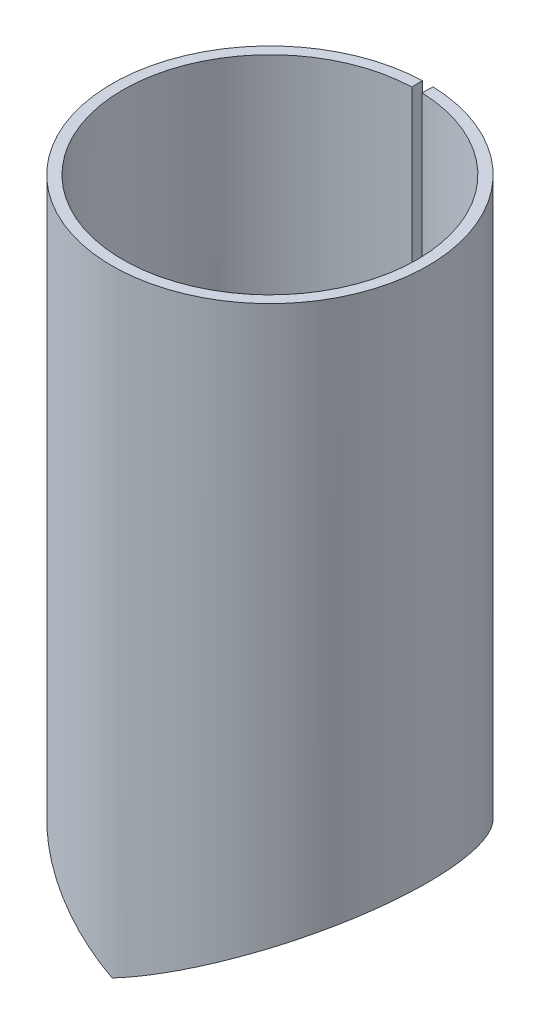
ISO-10303-21;
HEADER;
FILE_DESCRIPTION(('STEP AP214'),'2;1');
FILE_NAME('part.step','',(''),(''),'','','');
FILE_SCHEMA(('AUTOMOTIVE_DESIGN { 1 0 10303 214 1 1 1 1 }'));
ENDSEC;
DATA;
#1=APPLICATION_CONTEXT('core data for automotive mechanical design processes');
#2=APPLICATION_PROTOCOL_DEFINITION('international standard','automotive_design',2000,#1);
#3=PRODUCT_CONTEXT('',#1,'mechanical');
#4=PRODUCT('Part','Part','',(#3));
#5=PRODUCT_RELATED_PRODUCT_CATEGORY('part','',(#4));
#6=PRODUCT_DEFINITION_FORMATION('','',#4);
#7=PRODUCT_DEFINITION_CONTEXT('part definition',#1,'design');
#8=PRODUCT_DEFINITION('design','',#6,#7);
#9=PRODUCT_DEFINITION_SHAPE('','',#8);
#10=(LENGTH_UNIT() NAMED_UNIT(*) SI_UNIT(.MILLI.,.METRE.));
#11=(NAMED_UNIT(*) PLANE_ANGLE_UNIT() SI_UNIT($,.RADIAN.));
#12=(NAMED_UNIT(*) SI_UNIT($,.STERADIAN.) SOLID_ANGLE_UNIT());
#13=UNCERTAINTY_MEASURE_WITH_UNIT(LENGTH_MEASURE(1.E-05),#10,'distance_accuracy_value','');
#14=(GEOMETRIC_REPRESENTATION_CONTEXT(3) GLOBAL_UNCERTAINTY_ASSIGNED_CONTEXT((#13)) GLOBAL_UNIT_ASSIGNED_CONTEXT((#10,
#11,#12)) REPRESENTATION_CONTEXT('',''));
#15=CARTESIAN_POINT('',(0.,0.,0.));
#16=DIRECTION('',(0.,0.,1.));
#17=DIRECTION('',(1.,0.,0.));
#18=AXIS2_PLACEMENT_3D('',#15,#16,#17);
#19=CARTESIAN_POINT('',(0.465932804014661,28.802626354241,-13.6689368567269));
#20=DIRECTION('',(-0.999419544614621,0.,-0.0340671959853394));
#21=DIRECTION('',(0.,1.,0.));
#22=AXIS2_PLACEMENT_3D('',#19,#20,#21);
#23=PLANE('',#22);
#24=CARTESIAN_POINT('',(0.465932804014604,0.261949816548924,-13.6689368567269));
#25=CARTESIAN_POINT('',(0.499999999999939,0.261949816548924,-14.6683564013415));
#26=B_SPLINE_CURVE_WITH_KNOTS('',1,(#24,#25),.UNSPECIFIED.,.F.,.F.,(2,2),(0.,1.),.UNSPECIFIED.);
#27=CARTESIAN_POINT('',(0.46593280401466,0.261949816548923,-13.6689368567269));
#28=VERTEX_POINT('',#27);
#29=CARTESIAN_POINT('',(0.499999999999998,0.261949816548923,-14.6683564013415));
#30=VERTEX_POINT('',#29);
#31=EDGE_CURVE('E13',#28,#30,#26,.T.);
#32=ORIENTED_EDGE('',*,*,#31,.F.);
#33=DIRECTION('',(0.,1.,0.));
#34=VECTOR('',#33,1.);
#35=CARTESIAN_POINT('',(0.46593280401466,0.261949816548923,-13.6689368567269));
#36=LINE('',#35,#34);
#37=CARTESIAN_POINT('',(0.465932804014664,57.343302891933,-13.6689368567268));
#38=VERTEX_POINT('',#37);
#39=EDGE_CURVE('E150',#28,#38,#36,.T.);
#40=ORIENTED_EDGE('',*,*,#39,.T.);
#41=DIRECTION('',(0.0340671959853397,0.,-0.999419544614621));
#42=VECTOR('',#41,1.);
#43=CARTESIAN_POINT('',(0.465932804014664,57.343302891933,-13.6689368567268));
#44=LINE('',#43,#42);
#45=CARTESIAN_POINT('',(0.500000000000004,57.343302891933,-14.6683564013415));
#46=VERTEX_POINT('',#45);
#47=EDGE_CURVE('E52',#38,#46,#44,.T.);
#48=ORIENTED_EDGE('',*,*,#47,.T.);
#49=DIRECTION('',(0.,1.,0.));
#50=VECTOR('',#49,1.);
#51=CARTESIAN_POINT('',(0.499999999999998,-102.335426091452,-14.6683564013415));
#52=LINE('',#51,#50);
#53=EDGE_CURVE('E111',#30,#46,#52,.T.);
#54=ORIENTED_EDGE('',*,*,#53,.F.);
#55=EDGE_LOOP('',(#32,#40,#48,#54));
#56=FACE_BOUND('',#55,.T.);
#57=ADVANCED_FACE('F38',(#56),#23,.T.);
#58=CARTESIAN_POINT('',(0.,57.343302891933,0.));
#59=DIRECTION('',(0.,-1.,0.));
#60=DIRECTION('',(0.,0.,-1.));
#61=AXIS2_PLACEMENT_3D('',#58,#59,#60);
#62=PLANE('',#61);
#63=ORIENTED_EDGE('',*,*,#47,.F.);
#64=CARTESIAN_POINT('',(0.,57.343302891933,0.));
#65=DIRECTION('',(0.,1.,0.));
#66=DIRECTION('',(0.,0.,1.));
#67=AXIS2_PLACEMENT_3D('',#64,#65,#66);
#68=CIRCLE('',#67,13.6768756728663);
#69=CARTESIAN_POINT('',(-0.465932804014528,57.343302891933,-13.6689368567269));
#70=VERTEX_POINT('',#69);
#71=EDGE_CURVE('E101',#70,#38,#68,.T.);
#72=ORIENTED_EDGE('',*,*,#71,.F.);
#73=DIRECTION('',(-0.0340671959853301,0.,-0.999419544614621));
#74=VECTOR('',#73,1.);
#75=CARTESIAN_POINT('',(-0.465932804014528,57.343302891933,-13.6689368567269));
#76=LINE('',#75,#74);
#77=CARTESIAN_POINT('',(-0.499999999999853,57.343302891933,-14.6683564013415));
#78=VERTEX_POINT('',#77);
#79=EDGE_CURVE('E97',#70,#78,#76,.T.);
#80=ORIENTED_EDGE('',*,*,#79,.T.);
#81=CARTESIAN_POINT('',(0.,57.343302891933,0.));
#82=DIRECTION('',(0.,1.,0.));
#83=DIRECTION('',(0.,0.,1.));
#84=AXIS2_PLACEMENT_3D('',#81,#82,#83);
#85=CIRCLE('',#84,14.6768756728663);
#86=EDGE_CURVE('E100',#78,#46,#85,.T.);
#87=ORIENTED_EDGE('',*,*,#86,.T.);
#88=EDGE_LOOP('',(#63,#72,#80,#87));
#89=FACE_BOUND('',#88,.T.);
#90=ADVANCED_FACE('F99',(#89),#62,.F.);
#91=CARTESIAN_POINT('',(-0.465932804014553,28.802626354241,-13.6689368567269));
#92=DIRECTION('',(-0.999419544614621,0.,0.0340671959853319));
#93=DIRECTION('',(0.,1.,0.));
#94=AXIS2_PLACEMENT_3D('',#91,#92,#93);
#95=PLANE('',#94);
#96=ORIENTED_EDGE('',*,*,#79,.F.);
#97=DIRECTION('',(0.,1.,0.));
#98=VECTOR('',#97,1.);
#99=CARTESIAN_POINT('',(-0.465932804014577,0.261949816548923,-13.6689368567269));
#100=LINE('',#99,#98);
#101=CARTESIAN_POINT('',(-0.465932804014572,0.261949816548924,-13.6689368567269));
#102=VERTEX_POINT('',#101);
#103=EDGE_CURVE('E151',#102,#70,#100,.T.);
#104=ORIENTED_EDGE('',*,*,#103,.F.);
#105=CARTESIAN_POINT('',(-0.499999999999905,0.261949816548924,-14.6683564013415));
#106=CARTESIAN_POINT('',(-0.465932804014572,0.261949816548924,-13.6689368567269));
#107=B_SPLINE_CURVE_WITH_KNOTS('',1,(#105,#106),.UNSPECIFIED.,.F.,.F.,(2,2),(0.,1.),.UNSPECIFIED.);
#108=CARTESIAN_POINT('',(-0.499999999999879,0.261949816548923,-14.6683564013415));
#109=VERTEX_POINT('',#108);
#110=EDGE_CURVE('E93',#102,#109,#107,.F.);
#111=ORIENTED_EDGE('',*,*,#110,.T.);
#112=DIRECTION('',(0.,1.,0.));
#113=VECTOR('',#112,1.);
#114=CARTESIAN_POINT('',(-0.499999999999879,-102.335426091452,-14.6683564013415));
#115=LINE('',#114,#113);
#116=EDGE_CURVE('E108',#109,#78,#115,.T.);
#117=ORIENTED_EDGE('',*,*,#116,.T.);
#118=EDGE_LOOP('',(#96,#104,#111,#117));
#119=FACE_BOUND('',#118,.T.);
#120=ADVANCED_FACE('F113',(#119),#95,.F.);
#121=CARTESIAN_POINT('',(-0.499999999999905,0.261949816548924,-14.6683564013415));
#122=CARTESIAN_POINT('',(-1.0343329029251,0.541851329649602,-14.6501426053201));
#123=CARTESIAN_POINT('',(-1.5163771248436,0.794093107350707,-14.6047423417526));
#124=CARTESIAN_POINT('',(-2.37411875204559,1.24347723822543,-14.4900468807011));
#125=CARTESIAN_POINT('',(-2.74984122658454,1.44058291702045,-14.4207656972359));
#126=CARTESIAN_POINT('',(-3.15417765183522,1.65248203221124,-14.3341788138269));
#127=CARTESIAN_POINT('',(-3.23185642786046,1.69317329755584,-14.3168490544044));
#128=CARTESIAN_POINT('',(-3.38753168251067,1.77472261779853,-14.2808155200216));
#129=CARTESIAN_POINT('',(-3.46467407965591,1.81512929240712,-14.2622900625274));
#130=CARTESIAN_POINT('',(-3.69400431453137,1.93524535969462,-14.2052747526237));
#131=CARTESIAN_POINT('',(-3.84409444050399,2.01385079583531,-14.1653464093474));
#132=CARTESIAN_POINT('',(-4.28591286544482,2.24525127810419,-14.0404884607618));
#133=CARTESIAN_POINT('',(-4.56917880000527,2.39363049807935,-13.9504937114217));
#134=CARTESIAN_POINT('',(-5.11309379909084,2.67861340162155,-13.7604484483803));
#135=CARTESIAN_POINT('',(-5.3737449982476,2.81521708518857,-13.6603984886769));
#136=CARTESIAN_POINT('',(-5.8726849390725,3.07664891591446,-13.4534454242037));
#137=CARTESIAN_POINT('',(-6.11341634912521,3.20274746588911,-13.3455881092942));
#138=CARTESIAN_POINT('',(-6.81824400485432,3.57196728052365,-13.0074530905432));
#139=CARTESIAN_POINT('',(-7.26117556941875,3.80404629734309,-12.7641812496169));
#140=CARTESIAN_POINT('',(-7.8852681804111,4.13106353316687,-12.3811471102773));
#141=CARTESIAN_POINT('',(-8.08613322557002,4.23629644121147,-12.2507624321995));
#142=CARTESIAN_POINT('',(-8.47705523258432,4.44106655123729,-11.9835831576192));
#143=CARTESIAN_POINT('',(-8.66735968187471,4.54074922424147,-11.8465785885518));
#144=CARTESIAN_POINT('',(-9.22273398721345,4.83169009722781,-11.4266063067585));
#145=CARTESIAN_POINT('',(-9.57223900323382,5.01484115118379,-11.1346959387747));
#146=CARTESIAN_POINT('',(-10.2300584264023,5.3595242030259,-10.5335235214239));
#147=CARTESIAN_POINT('',(-10.5379538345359,5.52076505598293,-10.2249536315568));
#148=CARTESIAN_POINT('',(-11.1223869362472,5.82662207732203,-9.58596143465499));
#149=CARTESIAN_POINT('',(-11.3976775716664,5.97064714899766,-9.25656812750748));
#150=CARTESIAN_POINT('',(-12.1720807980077,6.37601204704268,-8.24456430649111));
#151=CARTESIAN_POINT('',(-12.6195416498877,6.61064155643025,-7.5382262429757));
#152=CARTESIAN_POINT('',(-13.1883714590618,6.90916518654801,-6.45323868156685));
#153=CARTESIAN_POINT('',(-13.3609689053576,6.99976962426,-6.08730688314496));
#154=CARTESIAN_POINT('',(-13.672798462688,7.16317162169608,-5.35026890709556));
#155=CARTESIAN_POINT('',(-13.8129492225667,7.23647314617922,-4.9770737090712));
#156=CARTESIAN_POINT('',(-14.4360722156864,7.56231388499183,-3.08883297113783));
#157=CARTESIAN_POINT('',(-14.6815927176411,7.69148636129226,-1.51307344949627));
#158=CARTESIAN_POINT('',(-14.6756098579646,7.68857681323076,0.434622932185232));
#159=CARTESIAN_POINT('',(-14.6589570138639,7.67976814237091,0.823781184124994));
#160=CARTESIAN_POINT('',(-14.5942823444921,7.64564482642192,1.60329629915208));
#161=CARTESIAN_POINT('',(-14.546254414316,7.62033778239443,1.99300645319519));
#162=CARTESIAN_POINT('',(-14.3546701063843,7.51968049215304,3.15812862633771));
#163=CARTESIAN_POINT('',(-14.1635002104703,7.41959408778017,3.92955334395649));
#164=CARTESIAN_POINT('',(-13.7818132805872,7.21999216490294,5.06272300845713));
#165=CARTESIAN_POINT('',(-13.6387900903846,7.14521280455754,5.43644550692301));
#166=CARTESIAN_POINT('',(-13.3215396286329,6.97916331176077,6.17317720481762));
#167=CARTESIAN_POINT('',(-13.1473565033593,6.88787840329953,6.53629487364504));
#168=CARTESIAN_POINT('',(-12.5740537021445,6.58745387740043,7.61351888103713));
#169=CARTESIAN_POINT('',(-12.1251642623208,6.35235465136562,8.31266840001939));
#170=CARTESIAN_POINT('',(-11.3522657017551,5.94748149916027,9.31204001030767));
#171=CARTESIAN_POINT('',(-11.0785400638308,5.80400015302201,9.63652430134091));
#172=CARTESIAN_POINT('',(-10.4936253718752,5.49750677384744,10.2703688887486));
#173=CARTESIAN_POINT('',(-10.1832655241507,5.33495946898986,10.578725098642));
#174=CARTESIAN_POINT('',(-9.5243145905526,4.98980456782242,11.1756768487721));
#175=CARTESIAN_POINT('',(-9.17324875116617,4.80578199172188,11.4664497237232));
#176=CARTESIAN_POINT('',(-8.42714961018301,4.41484658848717,12.0254360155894));
#177=CARTESIAN_POINT('',(-8.03295038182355,4.20839589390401,12.2931403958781));
#178=CARTESIAN_POINT('',(-7.19725587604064,3.77065716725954,12.8003554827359));
#179=CARTESIAN_POINT('',(-6.7502161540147,3.53636209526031,13.0431306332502));
#180=CARTESIAN_POINT('',(-6.03522891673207,3.16178092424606,13.3811879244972));
#181=CARTESIAN_POINT('',(-5.78951063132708,3.03306410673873,13.4895110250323));
#182=CARTESIAN_POINT('',(-5.4099264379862,2.83420423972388,13.6441211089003));
#183=CARTESIAN_POINT('',(-5.2820424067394,2.7672044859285,13.694168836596));
#184=CARTESIAN_POINT('',(-5.02017112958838,2.62998025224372,13.7923208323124));
#185=CARTESIAN_POINT('',(-4.88587213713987,2.55959494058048,13.8405241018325));
#186=CARTESIAN_POINT('',(-4.19742669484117,2.1988024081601,14.0759042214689));
#187=CARTESIAN_POINT('',(-3.59213814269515,1.88179726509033,14.2464083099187));
#188=CARTESIAN_POINT('',(-2.85028407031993,1.4932489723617,14.3976955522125));
#189=CARTESIAN_POINT('',(-2.76701507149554,1.44963364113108,14.4139385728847));
#190=CARTESIAN_POINT('',(-2.59880643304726,1.36151638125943,14.4452138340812));
#191=CARTESIAN_POINT('',(-2.51042029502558,1.31518715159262,14.4609086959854));
#192=CARTESIAN_POINT('',(-2.22335755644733,1.16466022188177,14.5087905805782));
#193=CARTESIAN_POINT('',(-2.00650800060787,1.05090708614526,14.5411250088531));
#194=CARTESIAN_POINT('',(-1.27874432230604,0.669442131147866,14.6292288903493));
#195=CARTESIAN_POINT('',(-0.690276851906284,0.361628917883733,14.6768756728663));
#196=CARTESIAN_POINT('',(0.,0.,14.6768756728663));
#197=CARTESIAN_POINT('',(-0.465932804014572,0.261949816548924,-13.6689368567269));
#198=CARTESIAN_POINT('',(-0.963857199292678,0.541850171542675,-13.6519641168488));
#199=CARTESIAN_POINT('',(-1.41305969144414,0.794093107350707,-13.6096571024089));
#200=CARTESIAN_POINT('',(-2.21235961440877,1.24347723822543,-13.5027763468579));
#201=CARTESIAN_POINT('',(-2.5624824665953,1.44058291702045,-13.4382155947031));
#202=CARTESIAN_POINT('',(-2.93926967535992,1.65248203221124,-13.3575282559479));
#203=CARTESIAN_POINT('',(-3.01165585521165,1.69317329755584,-13.3413792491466));
#204=CARTESIAN_POINT('',(-3.15672427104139,1.77472261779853,-13.3078008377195));
#205=CARTESIAN_POINT('',(-3.22861061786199,1.81512929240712,-13.2905376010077));
#206=CARTESIAN_POINT('',(-3.44231557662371,1.93524535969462,-13.2374069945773));
#207=CARTESIAN_POINT('',(-3.58217940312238,2.01385079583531,-13.2001991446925));
#208=CARTESIAN_POINT('',(-3.99389479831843,2.24525127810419,-13.0838483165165));
#209=CARTESIAN_POINT('',(-4.25786058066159,2.39363049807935,-12.9999853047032));
#210=CARTESIAN_POINT('',(-4.76471626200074,2.67861340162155,-12.8228886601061));
#211=CARTESIAN_POINT('',(-5.00760815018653,2.81521708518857,-12.7296555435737));
#212=CARTESIAN_POINT('',(-5.47255312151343,3.07664891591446,-12.5368031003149));
#213=CARTESIAN_POINT('',(-5.69688244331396,3.20274746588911,-12.4362945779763));
#214=CARTESIAN_POINT('',(-6.35368709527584,3.57196728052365,-12.1211981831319));
#215=CARTESIAN_POINT('',(-6.76643978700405,3.80404629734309,-11.8945015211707));
#216=CARTESIAN_POINT('',(-7.34801022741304,4.13106353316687,-11.537565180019));
#217=CARTESIAN_POINT('',(-7.5351894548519,4.23629644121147,-11.4160641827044));
#218=CARTESIAN_POINT('',(-7.89947622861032,4.44106655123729,-11.1670890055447));
#219=CARTESIAN_POINT('',(-8.076814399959,4.54074922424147,-11.0394191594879));
#220=CARTESIAN_POINT('',(-8.59434861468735,4.83169009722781,-10.6480614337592));
#221=CARTESIAN_POINT('',(-8.92004031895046,5.01484115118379,-10.3760402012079));
#222=CARTESIAN_POINT('',(-9.53303961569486,5.3595242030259,-9.81582830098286));
#223=CARTESIAN_POINT('',(-9.81995675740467,5.52076505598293,-9.52828263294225));
#224=CARTESIAN_POINT('',(-10.3645698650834,5.82662207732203,-8.9328277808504));
#225=CARTESIAN_POINT('',(-10.6211037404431,5.97064714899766,-8.62587748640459));
#226=CARTESIAN_POINT('',(-11.3427434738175,6.37601204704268,-7.68282593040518));
#227=CARTESIAN_POINT('',(-11.759716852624,6.61064155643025,-7.02461378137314));
#228=CARTESIAN_POINT('',(-12.2897897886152,6.90916518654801,-6.01355118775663));
#229=CARTESIAN_POINT('',(-12.4506274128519,6.99976962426,-5.67255192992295));
#230=CARTESIAN_POINT('',(-12.7412106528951,7.16317162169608,-4.98573158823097));
#231=CARTESIAN_POINT('',(-12.8718123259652,7.23647314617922,-4.63796381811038));
#232=CARTESIAN_POINT('',(-13.4524792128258,7.56231388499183,-2.87837721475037));
#233=CARTESIAN_POINT('',(-13.6812713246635,7.69148636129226,-1.40998111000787));
#234=CARTESIAN_POINT('',(-13.6756961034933,7.68857681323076,0.405010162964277));
#235=CARTESIAN_POINT('',(-13.6601778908,7.67976814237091,0.767653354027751));
#236=CARTESIAN_POINT('',(-13.5999097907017,7.64564482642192,1.49405668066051));
#237=CARTESIAN_POINT('',(-13.5551542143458,7.62033778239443,1.8572141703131));
#238=CARTESIAN_POINT('',(-13.3766233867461,7.51968049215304,2.94295145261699));
#239=CARTESIAN_POINT('',(-13.1984787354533,7.41959408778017,3.66181561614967));
#240=CARTESIAN_POINT('',(-12.8427978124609,7.21999216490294,4.71777745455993));
#241=CARTESIAN_POINT('',(-12.7095194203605,7.14521280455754,5.06603659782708));
#242=CARTESIAN_POINT('',(-12.4138846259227,6.97916331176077,5.75257152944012));
#243=CARTESIAN_POINT('',(-12.2515693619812,6.88787840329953,6.09094839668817));
#244=CARTESIAN_POINT('',(-11.7173281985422,6.58745387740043,7.09477640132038));
#245=CARTESIAN_POINT('',(-11.2990235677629,6.35235465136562,7.74628979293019));
#246=CARTESIAN_POINT('',(-10.5787859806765,5.94748149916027,8.67756982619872));
#247=CARTESIAN_POINT('',(-10.3237104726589,5.80400015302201,8.97994557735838));
#248=CARTESIAN_POINT('',(-9.77864858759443,5.49750677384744,9.5706035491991));
#249=CARTESIAN_POINT('',(-9.48943491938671,5.33495946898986,9.85795009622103));
#250=CARTESIAN_POINT('',(-8.87538120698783,4.98980456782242,10.4142289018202));
#251=CARTESIAN_POINT('',(-8.54823502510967,4.80578199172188,10.6851901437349));
#252=CARTESIAN_POINT('',(-7.85297089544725,4.41484658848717,11.2060902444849));
#253=CARTESIAN_POINT('',(-7.48563019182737,4.20839589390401,11.4555547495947));
#254=CARTESIAN_POINT('',(-6.70687522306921,3.77065716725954,11.9282110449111));
#255=CARTESIAN_POINT('',(-6.29029428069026,3.53636209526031,12.1544448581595));
#256=CARTESIAN_POINT('',(-5.62402226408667,3.16178092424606,12.4694688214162));
#257=CARTESIAN_POINT('',(-5.39504584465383,3.03306410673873,12.5704113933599));
#258=CARTESIAN_POINT('',(-5.04132438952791,2.83420423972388,12.7144872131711));
#259=CARTESIAN_POINT('',(-4.92215365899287,2.7672044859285,12.7611249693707));
#260=CARTESIAN_POINT('',(-4.67812482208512,2.62998025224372,12.8525894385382));
#261=CARTESIAN_POINT('',(-4.55297620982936,2.55959494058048,12.8975084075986));
#262=CARTESIAN_POINT('',(-3.91143757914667,2.1988024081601,13.1168510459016));
#263=CARTESIAN_POINT('',(-3.34738999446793,1.88179726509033,13.2757379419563));
#264=CARTESIAN_POINT('',(-2.65608169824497,1.4932489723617,13.4167173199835));
#265=CARTESIAN_POINT('',(-2.57848618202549,1.44963364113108,13.4318536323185));
#266=CARTESIAN_POINT('',(-2.4217383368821,1.36151638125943,13.4609979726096));
#267=CARTESIAN_POINT('',(-2.33937433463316,1.31518715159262,13.475623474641));
#268=CARTESIAN_POINT('',(-2.07187044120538,1.16466022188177,13.5202429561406));
#269=CARTESIAN_POINT('',(-1.86979579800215,1.05090708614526,13.5503742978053));
#270=CARTESIAN_POINT('',(-1.19161785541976,0.669442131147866,13.6324752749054));
#271=CARTESIAN_POINT('',(-0.643239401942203,0.361625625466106,13.6768756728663));
#272=CARTESIAN_POINT('',(0.,0.,13.6768756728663));
#273=B_SPLINE_SURFACE_WITH_KNOTS('',1,3,((#121,#122,#123,#124,#125,#126,#127,#128,#129,#130,
#131,#132,#133,#134,#135,#136,#137,#138,#139,#140,#141,#142,#143,#144,#145,#146,#147,#148,#149,
#150,#151,#152,#153,#154,#155,#156,#157,#158,#159,#160,#161,#162,#163,#164,#165,#166,#167,#168,
#169,#170,#171,#172,#173,#174,#175,#176,#177,#178,#179,#180,#181,#182,#183,#184,#185,#186,#187,
#188,#189,#190,#191,#192,#193,#194,#195,#196),(#197,#198,#199,#200,#201,#202,#203,#204,#205,
#206,#207,#208,#209,#210,#211,#212,#213,#214,#215,#216,#217,#218,#219,#220,#221,#222,#223,#224,
#225,#226,#227,#228,#229,#230,#231,#232,#233,#234,#235,#236,#237,#238,#239,#240,#241,#242,#243,
#244,#245,#246,#247,#248,#249,#250,#251,#252,#253,#254,#255,#256,#257,#258,#259,#260,#261,#262,
#263,#264,#265,#266,#267,#268,#269,#270,#271,#272)),.UNSPECIFIED.,.F.,.F.,.F.,(2,2),(4,2,2,2,2,
2,2,2,2,2,2,2,2,2,2,2,2,2,2,2,2,2,2,2,2,2,2,2,2,2,2,2,2,2,2,2,2,4),(0.,1.),(0.,0.015625,0.03125,
0.03515625,0.0390625,0.046875,0.0625,0.078125,0.09375,0.125,0.140625,0.15625,0.1875,0.21875,
0.25,0.3125,0.34375,0.375,0.5,0.53125,0.5625,0.625,0.65625,0.6875,0.75,0.78125,0.8125,0.84375,
0.875,0.90625,0.921875,0.9296875,0.9375,0.96875,0.97265625,0.9765625,0.984375,1.),.UNSPECIFIED.);
#274=CARTESIAN_POINT('',(-0.465932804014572,0.261949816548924,-13.6689368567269));
#275=CARTESIAN_POINT('',(-0.963857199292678,0.541850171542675,-13.6519641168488));
#276=CARTESIAN_POINT('',(-1.41305969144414,0.794093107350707,-13.6096571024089));
#277=CARTESIAN_POINT('',(-2.21235961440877,1.24347723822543,-13.5027763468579));
#278=CARTESIAN_POINT('',(-2.5624824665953,1.44058291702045,-13.4382155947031));
#279=CARTESIAN_POINT('',(-2.93926967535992,1.65248203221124,-13.3575282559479));
#280=CARTESIAN_POINT('',(-3.01165585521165,1.69317329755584,-13.3413792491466));
#281=CARTESIAN_POINT('',(-3.15672427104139,1.77472261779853,-13.3078008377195));
#282=CARTESIAN_POINT('',(-3.22861061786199,1.81512929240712,-13.2905376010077));
#283=CARTESIAN_POINT('',(-3.44231557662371,1.93524535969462,-13.2374069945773));
#284=CARTESIAN_POINT('',(-3.58217940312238,2.01385079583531,-13.2001991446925));
#285=CARTESIAN_POINT('',(-3.99389479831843,2.24525127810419,-13.0838483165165));
#286=CARTESIAN_POINT('',(-4.25786058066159,2.39363049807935,-12.9999853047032));
#287=CARTESIAN_POINT('',(-4.76471626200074,2.67861340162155,-12.8228886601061));
#288=CARTESIAN_POINT('',(-5.00760815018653,2.81521708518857,-12.7296555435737));
#289=CARTESIAN_POINT('',(-5.47255312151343,3.07664891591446,-12.5368031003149));
#290=CARTESIAN_POINT('',(-5.69688244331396,3.20274746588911,-12.4362945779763));
#291=CARTESIAN_POINT('',(-6.35368709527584,3.57196728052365,-12.1211981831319));
#292=CARTESIAN_POINT('',(-6.76643978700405,3.80404629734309,-11.8945015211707));
#293=CARTESIAN_POINT('',(-7.34801022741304,4.13106353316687,-11.537565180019));
#294=CARTESIAN_POINT('',(-7.5351894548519,4.23629644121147,-11.4160641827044));
#295=CARTESIAN_POINT('',(-7.89947622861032,4.44106655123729,-11.1670890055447));
#296=CARTESIAN_POINT('',(-8.076814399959,4.54074922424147,-11.0394191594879));
#297=CARTESIAN_POINT('',(-8.59434861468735,4.83169009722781,-10.6480614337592));
#298=CARTESIAN_POINT('',(-8.92004031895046,5.01484115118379,-10.3760402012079));
#299=CARTESIAN_POINT('',(-9.53303961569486,5.3595242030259,-9.81582830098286));
#300=CARTESIAN_POINT('',(-9.81995675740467,5.52076505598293,-9.52828263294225));
#301=CARTESIAN_POINT('',(-10.3645698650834,5.82662207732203,-8.9328277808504));
#302=CARTESIAN_POINT('',(-10.6211037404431,5.97064714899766,-8.62587748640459));
#303=CARTESIAN_POINT('',(-11.3427434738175,6.37601204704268,-7.68282593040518));
#304=CARTESIAN_POINT('',(-11.759716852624,6.61064155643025,-7.02461378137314));
#305=CARTESIAN_POINT('',(-12.2897897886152,6.90916518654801,-6.01355118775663));
#306=CARTESIAN_POINT('',(-12.4506274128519,6.99976962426,-5.67255192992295));
#307=CARTESIAN_POINT('',(-12.7412106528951,7.16317162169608,-4.98573158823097));
#308=CARTESIAN_POINT('',(-12.8718123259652,7.23647314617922,-4.63796381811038));
#309=CARTESIAN_POINT('',(-13.4524792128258,7.56231388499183,-2.87837721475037));
#310=CARTESIAN_POINT('',(-13.6812713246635,7.69148636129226,-1.40998111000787));
#311=CARTESIAN_POINT('',(-13.6756961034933,7.68857681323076,0.405010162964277));
#312=CARTESIAN_POINT('',(-13.6601778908,7.67976814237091,0.767653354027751));
#313=CARTESIAN_POINT('',(-13.5999097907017,7.64564482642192,1.49405668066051));
#314=CARTESIAN_POINT('',(-13.5551542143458,7.62033778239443,1.8572141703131));
#315=CARTESIAN_POINT('',(-13.3766233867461,7.51968049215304,2.94295145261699));
#316=CARTESIAN_POINT('',(-13.1984787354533,7.41959408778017,3.66181561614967));
#317=CARTESIAN_POINT('',(-12.8427978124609,7.21999216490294,4.71777745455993));
#318=CARTESIAN_POINT('',(-12.7095194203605,7.14521280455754,5.06603659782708));
#319=CARTESIAN_POINT('',(-12.4138846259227,6.97916331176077,5.75257152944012));
#320=CARTESIAN_POINT('',(-12.2515693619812,6.88787840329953,6.09094839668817));
#321=CARTESIAN_POINT('',(-11.7173281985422,6.58745387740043,7.09477640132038));
#322=CARTESIAN_POINT('',(-11.2990235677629,6.35235465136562,7.74628979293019));
#323=CARTESIAN_POINT('',(-10.5787859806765,5.94748149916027,8.67756982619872));
#324=CARTESIAN_POINT('',(-10.3237104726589,5.80400015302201,8.97994557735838));
#325=CARTESIAN_POINT('',(-9.77864858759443,5.49750677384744,9.5706035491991));
#326=CARTESIAN_POINT('',(-9.48943491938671,5.33495946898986,9.85795009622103));
#327=CARTESIAN_POINT('',(-8.87538120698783,4.98980456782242,10.4142289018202));
#328=CARTESIAN_POINT('',(-8.54823502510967,4.80578199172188,10.6851901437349));
#329=CARTESIAN_POINT('',(-7.85297089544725,4.41484658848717,11.2060902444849));
#330=CARTESIAN_POINT('',(-7.48563019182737,4.20839589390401,11.4555547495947));
#331=CARTESIAN_POINT('',(-6.70687522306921,3.77065716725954,11.9282110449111));
#332=CARTESIAN_POINT('',(-6.29029428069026,3.53636209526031,12.1544448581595));
#333=CARTESIAN_POINT('',(-5.62402226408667,3.16178092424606,12.4694688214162));
#334=CARTESIAN_POINT('',(-5.39504584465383,3.03306410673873,12.5704113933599));
#335=CARTESIAN_POINT('',(-5.04132438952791,2.83420423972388,12.7144872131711));
#336=CARTESIAN_POINT('',(-4.92215365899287,2.7672044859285,12.7611249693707));
#337=CARTESIAN_POINT('',(-4.67812482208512,2.62998025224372,12.8525894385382));
#338=CARTESIAN_POINT('',(-4.55297620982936,2.55959494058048,12.8975084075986));
#339=CARTESIAN_POINT('',(-3.91143757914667,2.1988024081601,13.1168510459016));
#340=CARTESIAN_POINT('',(-3.34738999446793,1.88179726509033,13.2757379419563));
#341=CARTESIAN_POINT('',(-2.65608169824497,1.4932489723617,13.4167173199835));
#342=CARTESIAN_POINT('',(-2.57848618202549,1.44963364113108,13.4318536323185));
#343=CARTESIAN_POINT('',(-2.4217383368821,1.36151638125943,13.4609979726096));
#344=CARTESIAN_POINT('',(-2.33937433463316,1.31518715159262,13.475623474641));
#345=CARTESIAN_POINT('',(-2.07187044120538,1.16466022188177,13.5202429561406));
#346=CARTESIAN_POINT('',(-1.86979579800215,1.05090708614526,13.5503742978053));
#347=CARTESIAN_POINT('',(-1.19161785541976,0.669442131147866,13.6324752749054));
#348=CARTESIAN_POINT('',(-0.643239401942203,0.361625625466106,13.6768756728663));
#349=CARTESIAN_POINT('',(0.,0.,13.6768756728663));
#350=B_SPLINE_CURVE_WITH_KNOTS('',3,(#274,#275,#276,#277,#278,#279,#280,#281,#282,#283,#284,
#285,#286,#287,#288,#289,#290,#291,#292,#293,#294,#295,#296,#297,#298,#299,#300,#301,#302,#303,
#304,#305,#306,#307,#308,#309,#310,#311,#312,#313,#314,#315,#316,#317,#318,#319,#320,#321,#322,
#323,#324,#325,#326,#327,#328,#329,#330,#331,#332,#333,#334,#335,#336,#337,#338,#339,#340,#341,
#342,#343,#344,#345,#346,#347,#348,#349),.UNSPECIFIED.,.F.,.F.,(4,2,2,2,2,2,2,2,2,2,2,2,2,2,2,2,
2,2,2,2,2,2,2,2,2,2,2,2,2,2,2,2,2,2,2,2,2,4),(0.,0.015625,0.03125,0.03515625,0.0390625,0.046875,
0.0625,0.078125,0.09375,0.125,0.140625,0.15625,0.1875,0.21875,0.25,0.3125,0.34375,0.375,0.5,
0.53125,0.5625,0.625,0.65625,0.6875,0.75,0.78125,0.8125,0.84375,0.875,0.90625,0.921875,
0.9296875,0.9375,0.96875,0.97265625,0.9765625,0.984375,1.),.UNSPECIFIED.);
#351=CARTESIAN_POINT('',(0.,0.,13.6768756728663));
#352=VERTEX_POINT('',#351);
#353=EDGE_CURVE('E154',#102,#352,#350,.T.);
#354=CARTESIAN_POINT('',(0.,0.,13.6768756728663));
#355=CARTESIAN_POINT('',(0.,0.,14.6768756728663));
#356=B_SPLINE_CURVE_WITH_KNOTS('',1,(#354,#355),.UNSPECIFIED.,.F.,.F.,(2,2),(0.,1.),.UNSPECIFIED.);
#357=CARTESIAN_POINT('',(-4.77214123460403E-07,2.50007554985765E-07,14.6768756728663));
#358=VERTEX_POINT('',#357);
#359=EDGE_CURVE('E269',#352,#358,#356,.T.);
#360=CARTESIAN_POINT('',(0.,0.,14.6768756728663));
#361=CARTESIAN_POINT('',(-0.690276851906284,0.361628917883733,14.6768756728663));
#362=CARTESIAN_POINT('',(-1.27874432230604,0.669442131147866,14.6292288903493));
#363=CARTESIAN_POINT('',(-2.00650800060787,1.05090708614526,14.5411250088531));
#364=CARTESIAN_POINT('',(-2.22335755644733,1.16466022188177,14.5087905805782));
#365=CARTESIAN_POINT('',(-2.51042029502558,1.31518715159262,14.4609086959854));
#366=CARTESIAN_POINT('',(-2.59880643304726,1.36151638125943,14.4452138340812));
#367=CARTESIAN_POINT('',(-2.76701507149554,1.44963364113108,14.4139385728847));
#368=CARTESIAN_POINT('',(-2.85028407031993,1.4932489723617,14.3976955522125));
#369=CARTESIAN_POINT('',(-3.59213814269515,1.88179726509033,14.2464083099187));
#370=CARTESIAN_POINT('',(-4.19742669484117,2.1988024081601,14.0759042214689));
#371=CARTESIAN_POINT('',(-4.88587213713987,2.55959494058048,13.8405241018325));
#372=CARTESIAN_POINT('',(-5.02017112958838,2.62998025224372,13.7923208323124));
#373=CARTESIAN_POINT('',(-5.2820424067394,2.7672044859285,13.694168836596));
#374=CARTESIAN_POINT('',(-5.4099264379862,2.83420423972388,13.6441211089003));
#375=CARTESIAN_POINT('',(-5.78951063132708,3.03306410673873,13.4895110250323));
#376=CARTESIAN_POINT('',(-6.03522891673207,3.16178092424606,13.3811879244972));
#377=CARTESIAN_POINT('',(-6.7502161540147,3.53636209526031,13.0431306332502));
#378=CARTESIAN_POINT('',(-7.19725587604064,3.77065716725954,12.8003554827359));
#379=CARTESIAN_POINT('',(-8.03295038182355,4.20839589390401,12.2931403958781));
#380=CARTESIAN_POINT('',(-8.42714961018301,4.41484658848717,12.0254360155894));
#381=CARTESIAN_POINT('',(-9.17324875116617,4.80578199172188,11.4664497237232));
#382=CARTESIAN_POINT('',(-9.5243145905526,4.98980456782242,11.1756768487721));
#383=CARTESIAN_POINT('',(-10.1832655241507,5.33495946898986,10.578725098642));
#384=CARTESIAN_POINT('',(-10.4936253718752,5.49750677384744,10.2703688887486));
#385=CARTESIAN_POINT('',(-11.0785400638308,5.80400015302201,9.63652430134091));
#386=CARTESIAN_POINT('',(-11.3522657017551,5.94748149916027,9.31204001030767));
#387=CARTESIAN_POINT('',(-12.1251642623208,6.35235465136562,8.31266840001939));
#388=CARTESIAN_POINT('',(-12.5740537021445,6.58745387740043,7.61351888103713));
#389=CARTESIAN_POINT('',(-13.1473565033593,6.88787840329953,6.53629487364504));
#390=CARTESIAN_POINT('',(-13.3215396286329,6.97916331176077,6.17317720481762));
#391=CARTESIAN_POINT('',(-13.6387900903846,7.14521280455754,5.43644550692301));
#392=CARTESIAN_POINT('',(-13.7818132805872,7.21999216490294,5.06272300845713));
#393=CARTESIAN_POINT('',(-14.1635002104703,7.41959408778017,3.92955334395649));
#394=CARTESIAN_POINT('',(-14.3546701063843,7.51968049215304,3.15812862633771));
#395=CARTESIAN_POINT('',(-14.546254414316,7.62033778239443,1.99300645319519));
#396=CARTESIAN_POINT('',(-14.5942823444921,7.64564482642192,1.60329629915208));
#397=CARTESIAN_POINT('',(-14.6589570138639,7.67976814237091,0.823781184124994));
#398=CARTESIAN_POINT('',(-14.6756098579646,7.68857681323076,0.434622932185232));
#399=CARTESIAN_POINT('',(-14.6815927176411,7.69148636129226,-1.51307344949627));
#400=CARTESIAN_POINT('',(-14.4360722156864,7.56231388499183,-3.08883297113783));
#401=CARTESIAN_POINT('',(-13.8129492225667,7.23647314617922,-4.9770737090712));
#402=CARTESIAN_POINT('',(-13.672798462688,7.16317162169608,-5.35026890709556));
#403=CARTESIAN_POINT('',(-13.3609689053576,6.99976962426,-6.08730688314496));
#404=CARTESIAN_POINT('',(-13.1883714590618,6.90916518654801,-6.45323868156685));
#405=CARTESIAN_POINT('',(-12.6195416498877,6.61064155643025,-7.5382262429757));
#406=CARTESIAN_POINT('',(-12.1720807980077,6.37601204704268,-8.24456430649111));
#407=CARTESIAN_POINT('',(-11.3976775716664,5.97064714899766,-9.25656812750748));
#408=CARTESIAN_POINT('',(-11.1223869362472,5.82662207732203,-9.58596143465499));
#409=CARTESIAN_POINT('',(-10.5379538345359,5.52076505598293,-10.2249536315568));
#410=CARTESIAN_POINT('',(-10.2300584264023,5.3595242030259,-10.5335235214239));
#411=CARTESIAN_POINT('',(-9.57223900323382,5.01484115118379,-11.1346959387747));
#412=CARTESIAN_POINT('',(-9.22273398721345,4.83169009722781,-11.4266063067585));
#413=CARTESIAN_POINT('',(-8.66735968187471,4.54074922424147,-11.8465785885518));
#414=CARTESIAN_POINT('',(-8.47705523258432,4.44106655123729,-11.9835831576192));
#415=CARTESIAN_POINT('',(-8.08613322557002,4.23629644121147,-12.2507624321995));
#416=CARTESIAN_POINT('',(-7.8852681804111,4.13106353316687,-12.3811471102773));
#417=CARTESIAN_POINT('',(-7.26117556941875,3.80404629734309,-12.7641812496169));
#418=CARTESIAN_POINT('',(-6.81824400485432,3.57196728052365,-13.0074530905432));
#419=CARTESIAN_POINT('',(-6.11341634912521,3.20274746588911,-13.3455881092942));
#420=CARTESIAN_POINT('',(-5.8726849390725,3.07664891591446,-13.4534454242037));
#421=CARTESIAN_POINT('',(-5.3737449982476,2.81521708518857,-13.6603984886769));
#422=CARTESIAN_POINT('',(-5.11309379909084,2.67861340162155,-13.7604484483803));
#423=CARTESIAN_POINT('',(-4.56917880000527,2.39363049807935,-13.9504937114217));
#424=CARTESIAN_POINT('',(-4.28591286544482,2.24525127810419,-14.0404884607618));
#425=CARTESIAN_POINT('',(-3.84409444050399,2.01385079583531,-14.1653464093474));
#426=CARTESIAN_POINT('',(-3.69400431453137,1.93524535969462,-14.2052747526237));
#427=CARTESIAN_POINT('',(-3.46467407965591,1.81512929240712,-14.2622900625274));
#428=CARTESIAN_POINT('',(-3.38753168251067,1.77472261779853,-14.2808155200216));
#429=CARTESIAN_POINT('',(-3.23185642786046,1.69317329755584,-14.3168490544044));
#430=CARTESIAN_POINT('',(-3.15417765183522,1.65248203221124,-14.3341788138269));
#431=CARTESIAN_POINT('',(-2.74984122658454,1.44058291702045,-14.4207656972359));
#432=CARTESIAN_POINT('',(-2.37411875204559,1.24347723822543,-14.4900468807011));
#433=CARTESIAN_POINT('',(-1.5163771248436,0.794093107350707,-14.6047423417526));
#434=CARTESIAN_POINT('',(-1.0343329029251,0.541851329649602,-14.6501426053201));
#435=CARTESIAN_POINT('',(-0.499999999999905,0.261949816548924,-14.6683564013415));
#436=B_SPLINE_CURVE_WITH_KNOTS('',3,(#360,#361,#362,#363,#364,#365,#366,#367,#368,#369,#370,
#371,#372,#373,#374,#375,#376,#377,#378,#379,#380,#381,#382,#383,#384,#385,#386,#387,#388,#389,
#390,#391,#392,#393,#394,#395,#396,#397,#398,#399,#400,#401,#402,#403,#404,#405,#406,#407,#408,
#409,#410,#411,#412,#413,#414,#415,#416,#417,#418,#419,#420,#421,#422,#423,#424,#425,#426,#427,
#428,#429,#430,#431,#432,#433,#434,#435),.UNSPECIFIED.,.F.,.F.,(4,2,2,2,2,2,2,2,2,2,2,2,2,2,2,2,
2,2,2,2,2,2,2,2,2,2,2,2,2,2,2,2,2,2,2,2,2,4),(0.,0.015625,0.0234375,0.02734375,0.03125,0.0625,
0.0703125,0.078125,0.09375,0.125,0.15625,0.1875,0.21875,0.25,0.3125,0.34375,0.375,0.4375,
0.46875,0.5,0.625,0.65625,0.6875,0.75,0.78125,0.8125,0.84375,0.859375,0.875,0.90625,0.921875,
0.9375,0.953125,0.9609375,0.96484375,0.96875,0.984375,1.),.UNSPECIFIED.);
#437=EDGE_CURVE('E114',#109,#358,#436,.F.);
#438=ORIENTED_EDGE('',*,*,#110,.F.);
#439=ORIENTED_EDGE('',*,*,#353,.T.);
#440=ORIENTED_EDGE('',*,*,#359,.T.);
#441=ORIENTED_EDGE('',*,*,#437,.F.);
#442=EDGE_LOOP('',(#438,#439,#440,#441));
#443=FACE_BOUND('',#442,.T.);
#444=ADVANCED_FACE('F139',(#443),#273,.T.);
#445=CARTESIAN_POINT('',(0.,0.,14.6768756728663));
#446=CARTESIAN_POINT('',(0.593711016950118,0.311038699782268,14.6768756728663));
#447=CARTESIAN_POINT('',(1.11266415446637,0.582490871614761,14.6414145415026));
#448=CARTESIAN_POINT('',(1.77696875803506,0.930561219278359,14.5706091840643));
#449=CARTESIAN_POINT('',(1.9794312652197,1.0367182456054,14.5439675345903));
#450=CARTESIAN_POINT('',(2.25484280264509,1.18115415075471,14.5029299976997));
#451=CARTESIAN_POINT('',(2.3419352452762,1.22683284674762,14.4890648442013));
#452=CARTESIAN_POINT('',(2.4655442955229,1.29165098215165,14.468362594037));
#453=CARTESIAN_POINT('',(2.5055757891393,1.31264037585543,14.4614773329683));
#454=CARTESIAN_POINT('',(2.56387099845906,1.34319948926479,14.4512156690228));
#455=CARTESIAN_POINT('',(2.58301073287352,1.35323169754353,14.4478061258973));
#456=CARTESIAN_POINT('',(2.61128301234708,1.36804876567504,14.442713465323));
#457=CARTESIAN_POINT('',(2.6206342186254,1.37294924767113,14.4410195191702));
#458=CARTESIAN_POINT('',(2.63455178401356,1.3802421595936,14.4384846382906));
#459=CARTESIAN_POINT('',(2.63917276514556,1.38266349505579,14.4376406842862));
#460=CARTESIAN_POINT('',(2.64607693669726,1.3862810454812,14.4363763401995));
#461=CARTESIAN_POINT('',(2.64837377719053,1.38748448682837,14.4359551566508));
#462=CARTESIAN_POINT('',(2.65181221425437,1.38928603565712,14.4353237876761));
#463=CARTESIAN_POINT('',(2.652957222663,1.38988594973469,14.4351133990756));
#464=CARTESIAN_POINT('',(2.65524496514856,1.39108457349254,14.434692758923));
#465=CARTESIAN_POINT('',(2.65562600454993,1.391284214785,14.4346227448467));
#466=CARTESIAN_POINT('',(3.14477197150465,1.64755841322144,14.3445648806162));
#467=CARTESIAN_POINT('',(3.60448850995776,1.88823937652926,14.2344598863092));
#468=CARTESIAN_POINT('',(4.25186971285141,2.22736673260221,14.0492939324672));
#469=CARTESIAN_POINT('',(4.46064984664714,2.33676016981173,13.984225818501));
#470=CARTESIAN_POINT('',(4.76333363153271,2.49537680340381,13.882818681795));
#471=CARTESIAN_POINT('',(4.86248139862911,2.54733676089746,13.8483813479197));
#472=CARTESIAN_POINT('',(5.0085946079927,2.6239083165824,13.7959174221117));
#473=CARTESIAN_POINT('',(5.05686432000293,2.64920410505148,13.7782947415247));
#474=CARTESIAN_POINT('',(5.12861874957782,2.68680569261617,13.7516762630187));
#475=CARTESIAN_POINT('',(5.15242853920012,2.69928253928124,13.7427726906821));
#476=CARTESIAN_POINT('',(5.18798095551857,2.71791228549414,13.7293733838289));
#477=CARTESIAN_POINT('',(5.19980471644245,2.72410794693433,13.7248996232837));
#478=CARTESIAN_POINT('',(5.21749982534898,2.73338005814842,13.7181782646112));
#479=CARTESIAN_POINT('',(5.22339143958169,2.73646719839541,13.7159360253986));
#480=CARTESIAN_POINT('',(5.23221873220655,2.74109256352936,13.7125700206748));
#481=CARTESIAN_POINT('',(5.23515947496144,2.74263346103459,13.7114475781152));
#482=CARTESIAN_POINT('',(5.24103758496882,2.74571347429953,13.709201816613));
#483=CARTESIAN_POINT('',(5.24337464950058,2.74693804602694,13.7083082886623));
#484=CARTESIAN_POINT('',(5.69951640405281,2.98594523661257,13.5337009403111));
#485=CARTESIAN_POINT('',(6.12999950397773,3.21141418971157,13.3432194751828));
#486=CARTESIAN_POINT('',(6.74206642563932,3.53208941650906,13.0386789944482));
#487=CARTESIAN_POINT('',(6.94049048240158,3.63605979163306,12.9340235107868));
#488=CARTESIAN_POINT('',(7.22976320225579,3.7876333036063,12.7731506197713));
#489=CARTESIAN_POINT('',(7.32479414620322,3.8374274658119,12.7188776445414));
#490=CARTESIAN_POINT('',(7.46525997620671,3.91102319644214,12.6365943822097));
#491=CARTESIAN_POINT('',(7.51173518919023,3.93537252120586,12.6090209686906));
#492=CARTESIAN_POINT('',(7.58092938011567,3.97162263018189,12.5674545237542));
#493=CARTESIAN_POINT('',(7.60390767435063,3.98366035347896,12.5535646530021));
#494=CARTESIAN_POINT('',(7.63824566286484,4.0016484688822,12.5326797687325));
#495=CARTESIAN_POINT('',(7.64967008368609,4.00763309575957,12.5257097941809));
#496=CARTESIAN_POINT('',(7.66677437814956,4.01659291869,12.5152424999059));
#497=CARTESIAN_POINT('',(7.67247042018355,4.01957667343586,12.5117513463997));
#498=CARTESIAN_POINT('',(7.68385172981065,4.02553847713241,12.5047649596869));
#499=CARTESIAN_POINT('',(7.68874062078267,4.02809937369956,12.5017600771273));
#500=CARTESIAN_POINT('',(8.10969747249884,4.24860202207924,12.2425655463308));
#501=CARTESIAN_POINT('',(8.50245350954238,4.45432947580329,11.9722927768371));
#502=CARTESIAN_POINT('',(9.0588199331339,4.74584638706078,11.5500072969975));
#503=CARTESIAN_POINT('',(9.23882274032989,4.84017297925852,11.4064285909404));
#504=CARTESIAN_POINT('',(9.5006969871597,4.97739430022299,11.1875100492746));
#505=CARTESIAN_POINT('',(9.58663387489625,5.02242331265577,11.1139451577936));
#506=CARTESIAN_POINT('',(9.71351756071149,5.08889968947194,11.0027913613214));
#507=CARTESIAN_POINT('',(9.75547520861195,5.11088062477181,10.9656056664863));
#508=CARTESIAN_POINT('',(9.8179078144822,5.14358524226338,10.9096355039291));
#509=CARTESIAN_POINT('',(9.83863470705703,5.15444231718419,10.8909468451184));
#510=CARTESIAN_POINT('',(9.86959928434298,5.17066123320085,10.8628671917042));
#511=CARTESIAN_POINT('',(9.87989984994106,5.17605642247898,10.8534995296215));
#512=CARTESIAN_POINT('',(9.89531928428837,5.18413253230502,10.8394365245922));
#513=CARTESIAN_POINT('',(9.90045386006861,5.18682178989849,10.8347469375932));
#514=CARTESIAN_POINT('',(9.91071254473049,5.19219474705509,10.8253639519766));
#515=CARTESIAN_POINT('',(9.91510580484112,5.1944956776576,10.8213409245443));
#516=CARTESIAN_POINT('',(10.6697205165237,5.58971162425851,10.1291704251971));
#517=CARTESIAN_POINT('',(11.3290188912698,5.93437174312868,9.38091673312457));
#518=CARTESIAN_POINT('',(12.1796950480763,6.38012371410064,8.20366412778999));
#519=CARTESIAN_POINT('',(12.4403121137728,6.51683466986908,7.80206982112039));
#520=CARTESIAN_POINT('',(12.7971568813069,6.70409155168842,7.19021558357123));
#521=CARTESIAN_POINT('',(12.910430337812,6.76354225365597,6.98468413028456));
#522=CARTESIAN_POINT('',(13.0719148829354,6.84826591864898,6.67452671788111));
#523=CARTESIAN_POINT('',(13.1243390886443,6.87576507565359,6.57083067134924));
#524=CARTESIAN_POINT('',(13.2008828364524,6.91590071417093,6.41488308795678));
#525=CARTESIAN_POINT('',(13.2260486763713,6.92909374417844,6.3628332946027));
#526=CARTESIAN_POINT('',(13.2632761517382,6.94860501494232,6.28466531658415));
#527=CARTESIAN_POINT('',(13.2755984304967,6.9550623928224,6.25859377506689));
#528=CARTESIAN_POINT('',(13.2939517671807,6.96467889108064,6.21946408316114));
#529=CARTESIAN_POINT('',(13.300047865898,6.96787279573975,6.2064171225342));
#530=CARTESIAN_POINT('',(13.3091595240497,6.97264626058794,6.18684120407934));
#531=CARTESIAN_POINT('',(13.3121913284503,6.97423451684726,6.1803149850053));
#532=CARTESIAN_POINT('',(13.3182441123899,6.97740523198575,6.16726074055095));
#533=CARTESIAN_POINT('',(13.3209167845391,6.97880524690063,6.16148682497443));
#534=CARTESIAN_POINT('',(13.7548569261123,7.20610378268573,5.22197613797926));
#535=CARTESIAN_POINT('',(14.0837733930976,7.37780317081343,4.25197834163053));
#536=CARTESIAN_POINT('',(14.4211773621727,7.55459653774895,2.77410369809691));
#537=CARTESIAN_POINT('',(14.5077285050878,7.60006837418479,2.27765881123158));
#538=CARTESIAN_POINT('',(14.5989189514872,7.64808720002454,1.53135694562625));
#539=CARTESIAN_POINT('',(14.6228809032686,7.66072865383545,1.28231601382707));
#540=CARTESIAN_POINT('',(14.6492408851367,7.67464360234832,0.908843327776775));
#541=CARTESIAN_POINT('',(14.6564306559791,7.67844071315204,0.784367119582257));
#542=CARTESIAN_POINT('',(14.6676311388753,7.68435252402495,0.535526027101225));
#543=CARTESIAN_POINT('',(14.6716292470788,7.6864606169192,0.411805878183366));
#544=CARTESIAN_POINT('',(14.6936088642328,7.69798153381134,-0.7124149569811));
#545=CARTESIAN_POINT('',(14.6108320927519,7.65399217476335,-1.72056079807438));
#546=CARTESIAN_POINT('',(14.3296569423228,7.50666287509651,-3.21374042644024));
#547=CARTESIAN_POINT('',(14.2098324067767,7.44399556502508,-3.70827128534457));
#548=CARTESIAN_POINT('',(13.9911524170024,7.32965828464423,-4.44109411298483));
#549=CARTESIAN_POINT('',(13.9117732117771,7.28815647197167,-4.68387214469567));
#550=CARTESIAN_POINT('',(13.7830439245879,7.22081967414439,-5.0452683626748));
#551=CARTESIAN_POINT('',(13.7385243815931,7.19752672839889,-5.16527194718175));
#552=CARTESIAN_POINT('',(13.6693416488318,7.16131629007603,-5.34451870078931));
#553=CARTESIAN_POINT('',(13.6458801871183,7.14903430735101,-5.4041411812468));
#554=CARTESIAN_POINT('',(13.6100887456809,7.13029357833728,-5.49337700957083));
#555=CARTESIAN_POINT('',(13.5980583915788,7.12399370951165,-5.52308930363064));
#556=CARTESIAN_POINT('',(13.5798632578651,7.11446446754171,-5.56760724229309));
#557=CARTESIAN_POINT('',(13.5737732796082,7.11127481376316,-5.58243813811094));
#558=CARTESIAN_POINT('',(13.5646009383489,7.10647047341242,-5.60467172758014));
#559=CARTESIAN_POINT('',(13.5615372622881,7.10486571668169,-5.61208079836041));
#560=CARTESIAN_POINT('',(13.5553974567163,7.10164958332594,-5.62689466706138));
#561=CARTESIAN_POINT('',(13.5520277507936,7.09988441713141,-5.63500452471));
#562=CARTESIAN_POINT('',(13.1922754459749,6.91142870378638,-6.49899376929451));
#563=CARTESIAN_POINT('',(12.7450225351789,6.67633651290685,-7.34314800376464));
#564=CARTESIAN_POINT('',(11.9343392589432,6.25155216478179,-8.55680498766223));
#565=CARTESIAN_POINT('',(11.6408855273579,6.09793303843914,-8.95254515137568));
#566=CARTESIAN_POINT('',(11.1660786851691,5.84946783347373,-9.52844512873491));
#567=CARTESIAN_POINT('',(11.002044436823,5.76364001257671,-9.71745776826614));
#568=CARTESIAN_POINT('',(10.7474259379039,5.63038915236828,-9.99596604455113));
#569=CARTESIAN_POINT('',(10.661125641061,5.58522067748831,-10.0879669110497));
#570=CARTESIAN_POINT('',(10.5295476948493,5.51634068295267,-10.2246420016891));
#571=CARTESIAN_POINT('',(10.4853338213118,5.49319280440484,-10.2699793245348));
#572=CARTESIAN_POINT('',(10.4184831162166,5.45818916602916,-10.3376445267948));
#573=CARTESIAN_POINT('',(10.3961112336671,5.44647431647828,-10.3601427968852));
#574=CARTESIAN_POINT('',(10.3624211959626,5.42883158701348,-10.3938038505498));
#575=CARTESIAN_POINT('',(10.3511691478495,5.4229389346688,-10.4050098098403));
#576=CARTESIAN_POINT('',(10.3342580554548,5.41408234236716,-10.4217970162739));
#577=CARTESIAN_POINT('',(10.3286155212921,5.41112720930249,-10.4273891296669));
#578=CARTESIAN_POINT('',(10.3173194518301,5.40521107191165,-10.4385660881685));
#579=CARTESIAN_POINT('',(10.310988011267,5.40189501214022,-10.4448195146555));
#580=CARTESIAN_POINT('',(9.9872147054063,5.23231751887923,-10.76413965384));
#581=CARTESIAN_POINT('',(9.64686710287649,5.05391688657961,-11.0710188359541));
#582=CARTESIAN_POINT('',(9.10343145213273,4.76916790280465,-11.5148999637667));
#583=CARTESIAN_POINT('',(8.91680718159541,4.67139356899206,-11.6601159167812));
#584=CARTESIAN_POINT('',(8.62864485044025,4.52044505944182,-11.8731392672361));
#585=CARTESIAN_POINT('',(8.53122023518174,4.46941438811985,-11.943346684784));
#586=CARTESIAN_POINT('',(8.38303115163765,4.39179662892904,-12.0473694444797));
#587=CARTESIAN_POINT('',(8.3332927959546,4.36574541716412,-12.0818289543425));
#588=CARTESIAN_POINT('',(8.25817301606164,4.32640066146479,-12.1331849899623));
#589=CARTESIAN_POINT('',(8.23304771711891,4.31324108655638,-12.1502481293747));
#590=CARTESIAN_POINT('',(8.19523182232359,4.29343473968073,-12.1757581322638));
#591=CARTESIAN_POINT('',(8.18260519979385,4.28682145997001,-12.1842473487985));
#592=CARTESIAN_POINT('',(8.16363329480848,4.27688479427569,-12.1969598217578));
#593=CARTESIAN_POINT('',(8.15730399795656,4.27356978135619,-12.2011937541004));
#594=CARTESIAN_POINT('',(8.14463474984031,4.26693417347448,-12.2096544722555));
#595=CARTESIAN_POINT('',(8.13754493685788,4.26322083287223,-12.2143803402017));
#596=CARTESIAN_POINT('',(7.77384293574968,4.07272921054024,-12.4564478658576));
#597=CARTESIAN_POINT('',(7.3938760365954,3.87359265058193,-12.686626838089));
#598=CARTESIAN_POINT('',(6.79061497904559,3.55752444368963,-13.0134750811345));
#599=CARTESIAN_POINT('',(6.58398446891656,3.44927448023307,-13.1193481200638));
#600=CARTESIAN_POINT('',(6.26574131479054,3.2825586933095,-13.2727175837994));
#601=CARTESIAN_POINT('',(6.15827798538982,3.22626329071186,-13.322933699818));
#602=CARTESIAN_POINT('',(5.99501764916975,3.14073497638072,-13.3967910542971));
#603=CARTESIAN_POINT('',(5.94025335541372,3.11204466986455,-13.4211656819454));
#604=CARTESIAN_POINT('',(5.85759203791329,3.06873790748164,-13.4573474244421));
#605=CARTESIAN_POINT('',(5.82995245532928,3.05425710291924,-13.469344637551));
#606=CARTESIAN_POINT('',(5.78836456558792,3.03246807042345,-13.4872437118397));
#607=CARTESIAN_POINT('',(5.77448051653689,3.02519375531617,-13.493193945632));
#608=CARTESIAN_POINT('',(5.75362234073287,3.01426532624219,-13.5020948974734));
#609=CARTESIAN_POINT('',(5.74666426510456,3.010619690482,-13.5050578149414));
#610=CARTESIAN_POINT('',(5.73621912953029,3.00514699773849,-13.5094960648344));
#611=CARTESIAN_POINT('',(5.73273608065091,3.0033220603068,-13.5109744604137));
#612=CARTESIAN_POINT('',(5.72576730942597,2.99967077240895,-13.5139292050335));
#613=CARTESIAN_POINT('',(5.7217270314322,2.99755386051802,-13.5156401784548));
#614=CARTESIAN_POINT('',(5.34343412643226,2.79934593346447,-13.6756903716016));
#615=CARTESIAN_POINT('',(4.94188857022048,2.58886850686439,-13.827178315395));
#616=CARTESIAN_POINT('',(4.29969275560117,2.25244337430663,-14.0347402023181));
#617=CARTESIAN_POINT('',(4.07899287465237,2.13685016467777,-14.1006377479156));
#618=CARTESIAN_POINT('',(3.7380381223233,1.95828310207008,-14.1933654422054));
#619=CARTESIAN_POINT('',(3.62273665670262,1.89789787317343,-14.2232542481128));
#620=CARTESIAN_POINT('',(3.44732453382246,1.80602571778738,-14.2664031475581));
#621=CARTESIAN_POINT('',(3.38844390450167,1.77518594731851,-14.2805053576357));
#622=CARTESIAN_POINT('',(3.29951054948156,1.72860271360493,-14.3012179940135));
#623=CARTESIAN_POINT('',(3.26976403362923,1.71302103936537,-14.3080487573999));
#624=CARTESIAN_POINT('',(3.22499151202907,1.68956763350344,-14.318182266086));
#625=CARTESIAN_POINT('',(3.21004188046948,1.68173634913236,-14.3215413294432));
#626=CARTESIAN_POINT('',(3.1875792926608,1.66996919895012,-14.3265514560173));
#627=CARTESIAN_POINT('',(3.18008540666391,1.66604344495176,-14.3282167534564));
#628=CARTESIAN_POINT('',(3.16883504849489,1.66014975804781,-14.3307075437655));
#629=CARTESIAN_POINT('',(3.16508334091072,1.65818435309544,-14.3315366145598));
#630=CARTESIAN_POINT('',(3.15945339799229,1.65523498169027,-14.3327784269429));
#631=CARTESIAN_POINT('',(3.15757635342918,1.65425164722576,-14.3331920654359));
#632=CARTESIAN_POINT('',(3.1538214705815,1.65228455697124,-14.3340187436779));
#633=CARTESIAN_POINT('',(3.15133989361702,1.65098451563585,-14.334564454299));
#634=CARTESIAN_POINT('',(2.82379431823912,1.47939052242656,-14.4065422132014));
#635=CARTESIAN_POINT('',(2.44040883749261,1.27823011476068,-14.4794268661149));
#636=CARTESIAN_POINT('',(1.55715892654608,0.815441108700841,-14.6008442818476));
#637=CARTESIAN_POINT('',(1.05725907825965,0.553855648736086,-14.6493611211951));
#638=CARTESIAN_POINT('',(0.499999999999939,0.261949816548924,-14.6683564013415));
#639=CARTESIAN_POINT('',(0.,0.,13.6768756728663));
#640=CARTESIAN_POINT('',(0.553255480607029,0.311036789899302,13.6768756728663));
#641=CARTESIAN_POINT('',(1.03685345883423,0.582490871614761,13.6438306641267));
#642=CARTESIAN_POINT('',(1.65589607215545,0.930561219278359,13.5778495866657));
#643=CARTESIAN_POINT('',(1.84456391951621,1.0367182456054,13.5530231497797));
#644=CARTESIAN_POINT('',(2.1012104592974,1.18115415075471,13.5147816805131));
#645=CARTESIAN_POINT('',(2.1823689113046,1.22683284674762,13.5018612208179));
#646=CARTESIAN_POINT('',(2.29755593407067,1.29165098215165,13.482569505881));
#647=CARTESIAN_POINT('',(2.33485990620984,1.31264037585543,13.4761533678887));
#648=CARTESIAN_POINT('',(2.38918320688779,1.34319948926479,13.4665908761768));
#649=CARTESIAN_POINT('',(2.40701886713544,1.35323169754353,13.463413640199));
#650=CARTESIAN_POINT('',(2.43336483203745,1.36804876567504,13.4586679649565));
#651=CARTESIAN_POINT('',(2.44207889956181,1.37294924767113,13.4570894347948));
#652=CARTESIAN_POINT('',(2.45504820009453,1.3802421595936,13.4547272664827));
#653=CARTESIAN_POINT('',(2.45935433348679,1.38266349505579,13.4539408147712));
#654=CARTESIAN_POINT('',(2.46578809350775,1.3862810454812,13.4527626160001));
#655=CARTESIAN_POINT('',(2.46792844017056,1.38748448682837,13.4523701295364));
#656=CARTESIAN_POINT('',(2.47113260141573,1.38928603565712,13.4517817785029));
#657=CARTESIAN_POINT('',(2.47219959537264,1.38988594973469,13.4515857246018));
#658=CARTESIAN_POINT('',(2.47433146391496,1.39108457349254,13.4511937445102));
#659=CARTESIAN_POINT('',(2.4746865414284,1.391284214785,13.4511285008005));
#660=CARTESIAN_POINT('',(2.93050484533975,1.64755841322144,13.3672066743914));
#661=CARTESIAN_POINT('',(3.35889887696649,1.88823937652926,13.2646036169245));
#662=CARTESIAN_POINT('',(3.96217115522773,2.22736673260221,13.0920538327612));
#663=CARTESIAN_POINT('',(4.15672618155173,2.33676016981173,13.0314190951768));
#664=CARTESIAN_POINT('',(4.43878679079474,2.49537680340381,12.9369212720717));
#665=CARTESIAN_POINT('',(4.53117918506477,2.54733676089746,12.9048303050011));
#666=CARTESIAN_POINT('',(4.6673370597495,2.6239083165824,12.8559409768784));
#667=CARTESIAN_POINT('',(4.71231794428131,2.64920410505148,12.8395190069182));
#668=CARTESIAN_POINT('',(4.77918342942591,2.68680569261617,12.8147141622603));
#669=CARTESIAN_POINT('',(4.80137095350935,2.69928253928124,12.8064172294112));
#670=CARTESIAN_POINT('',(4.83450102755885,2.71791228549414,12.7939308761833));
#671=CARTESIAN_POINT('',(4.84551918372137,2.72410794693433,12.7897619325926));
#672=CARTESIAN_POINT('',(4.8620086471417,2.73338005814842,12.7834985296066));
#673=CARTESIAN_POINT('',(4.86749883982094,2.73646719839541,12.7814090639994));
#674=CARTESIAN_POINT('',(4.87572469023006,2.74109256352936,12.7782723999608));
#675=CARTESIAN_POINT('',(4.87846506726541,2.74263346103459,12.7772264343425));
#676=CARTESIAN_POINT('',(4.8839426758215,2.74571347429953,12.7751336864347));
#677=CARTESIAN_POINT('',(4.88612050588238,2.74693804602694,12.7743010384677));
#678=CARTESIAN_POINT('',(5.31118331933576,2.98594523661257,12.61159045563));
#679=CARTESIAN_POINT('',(5.71233571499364,3.21141418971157,12.4340873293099));
#680=CARTESIAN_POINT('',(6.28269982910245,3.53208941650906,12.1502965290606));
#681=CARTESIAN_POINT('',(6.46760438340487,3.63605979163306,12.0527716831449));
#682=CARTESIAN_POINT('',(6.73716768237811,3.7876333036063,11.9028597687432));
#683=CARTESIAN_POINT('',(6.82572375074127,3.8374274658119,11.8522846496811));
#684=CARTESIAN_POINT('',(6.95661902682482,3.91102319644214,11.7756077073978));
#685=CARTESIAN_POINT('',(6.99992767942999,3.93537252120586,11.7499129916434));
#686=CARTESIAN_POINT('',(7.06440736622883,3.97162263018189,11.7111786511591));
#687=CARTESIAN_POINT('',(7.08582004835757,3.98366035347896,11.6982351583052));
#688=CARTESIAN_POINT('',(7.11781843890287,4.0016484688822,11.6787732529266));
#689=CARTESIAN_POINT('',(7.12846446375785,4.00763309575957,11.6722781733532));
#690=CARTESIAN_POINT('',(7.14440336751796,4.01659291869,11.6625240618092));
#691=CARTESIAN_POINT('',(7.14971131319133,4.01957667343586,11.6592707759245));
#692=CARTESIAN_POINT('',(7.16031716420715,4.02553847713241,11.6527604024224));
#693=CARTESIAN_POINT('',(7.16487295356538,4.02809937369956,11.649960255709));
#694=CARTESIAN_POINT('',(7.55714816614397,4.24860202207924,11.4084257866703));
#695=CARTESIAN_POINT('',(7.92314400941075,4.45432947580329,11.1565678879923));
#696=CARTESIAN_POINT('',(8.44160274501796,4.74584638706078,10.7630545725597));
#697=CARTESIAN_POINT('',(8.60934117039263,4.84017297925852,10.6292585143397));
#698=CARTESIAN_POINT('',(8.85337277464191,4.97739430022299,10.4252558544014));
#699=CARTESIAN_POINT('',(8.93345440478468,5.02242331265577,10.3567032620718));
#700=CARTESIAN_POINT('',(9.0516929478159,5.08889968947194,10.2531228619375));
#701=CARTESIAN_POINT('',(9.09079183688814,5.11088062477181,10.21847079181));
#702=CARTESIAN_POINT('',(9.14897063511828,5.14358524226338,10.1663141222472));
#703=CARTESIAN_POINT('',(9.16828531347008,5.15444231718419,10.1488988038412));
#704=CARTESIAN_POINT('',(9.19714013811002,5.17066123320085,10.1227323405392));
#705=CARTESIAN_POINT('',(9.20673888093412,5.17605642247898,10.1140029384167));
#706=CARTESIAN_POINT('',(9.22110772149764,5.18413253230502,10.1008981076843));
#707=CARTESIAN_POINT('',(9.22589245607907,5.18682178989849,10.0965280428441));
#708=CARTESIAN_POINT('',(9.23545217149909,5.19219474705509,10.0877843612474));
#709=CARTESIAN_POINT('',(9.23954609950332,5.1944956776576,10.0840354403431));
#710=CARTESIAN_POINT('',(9.94274559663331,5.58971162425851,9.43902555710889));
#711=CARTESIAN_POINT('',(10.5571230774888,5.93437174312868,8.74175367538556));
#712=CARTESIAN_POINT('',(11.3498389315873,6.38012371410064,7.64471246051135));
#713=CARTESIAN_POINT('',(11.5926990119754,6.51683466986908,7.27048053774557));
#714=CARTESIAN_POINT('',(11.9252303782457,6.70409155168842,6.7003146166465));
#715=CARTESIAN_POINT('',(12.0307860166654,6.76354225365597,6.50878692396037));
#716=CARTESIAN_POINT('',(12.1812679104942,6.84826591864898,6.21976189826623));
#717=CARTESIAN_POINT('',(12.2301202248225,6.87576507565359,6.12313111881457));
#718=CARTESIAN_POINT('',(12.3014487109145,6.91590071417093,5.97780892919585));
#719=CARTESIAN_POINT('',(12.3248998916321,6.92909374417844,5.92930551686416));
#720=CARTESIAN_POINT('',(12.3595908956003,6.94860501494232,5.85646346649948));
#721=CARTESIAN_POINT('',(12.3710736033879,6.9550623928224,5.83216829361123));
#722=CARTESIAN_POINT('',(12.3881764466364,6.96467889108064,5.79570467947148));
#723=CARTESIAN_POINT('',(12.3938571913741,6.96787279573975,5.78354666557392));
#724=CARTESIAN_POINT('',(12.4023480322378,6.97264626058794,5.76530454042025));
#725=CARTESIAN_POINT('',(12.405173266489,6.97423451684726,5.75922298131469));
#726=CARTESIAN_POINT('',(12.4108136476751,6.97740523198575,5.74705817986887));
#727=CARTESIAN_POINT('',(12.4133042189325,6.97880524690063,5.74167766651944));
#728=CARTESIAN_POINT('',(12.8176781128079,7.20610378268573,4.86617996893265));
#729=CARTESIAN_POINT('',(13.1241840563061,7.37780317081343,3.96227238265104));
#730=CARTESIAN_POINT('',(13.4385992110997,7.55459653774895,2.58509182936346));
#731=CARTESIAN_POINT('',(13.519253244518,7.60006837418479,2.12247191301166));
#732=CARTESIAN_POINT('',(13.6042304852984,7.64808720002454,1.42701887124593));
#733=CARTESIAN_POINT('',(13.6265598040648,7.66072865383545,1.1949461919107));
#734=CARTESIAN_POINT('',(13.6511237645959,7.67464360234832,0.846919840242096));
#735=CARTESIAN_POINT('',(13.6578236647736,7.67844071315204,0.730924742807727));
#736=CARTESIAN_POINT('',(13.6682610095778,7.68435252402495,0.499038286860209));
#737=CARTESIAN_POINT('',(13.6719867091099,7.6864606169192,0.383747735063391));
#738=CARTESIAN_POINT('',(13.6924687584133,7.69798153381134,-0.663874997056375));
#739=CARTESIAN_POINT('',(13.6153319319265,7.65399217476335,-1.603331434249));
#740=CARTESIAN_POINT('',(13.3533144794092,7.50666287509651,-2.99477417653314));
#741=CARTESIAN_POINT('',(13.2416541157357,7.44399556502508,-3.45561047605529));
#742=CARTESIAN_POINT('',(13.0378737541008,7.32965828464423,-4.13850286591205));
#743=CARTESIAN_POINT('',(12.9639030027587,7.28815647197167,-4.36473936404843));
#744=CARTESIAN_POINT('',(12.8439446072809,7.22081967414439,-4.70151207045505));
#745=CARTESIAN_POINT('',(12.8024583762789,7.19752672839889,-4.81333928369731));
#746=CARTESIAN_POINT('',(12.7379893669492,7.16131629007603,-4.98037316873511));
#747=CARTESIAN_POINT('',(12.7161264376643,7.14903430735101,-5.03593330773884));
#748=CARTESIAN_POINT('',(12.6827736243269,7.13029357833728,-5.11908910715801));
#749=CARTESIAN_POINT('',(12.6715629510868,7.12399370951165,-5.14677697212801));
#750=CARTESIAN_POINT('',(12.6546075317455,7.11446446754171,-5.1882617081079));
#751=CARTESIAN_POINT('',(12.6489324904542,7.11127481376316,-5.20208210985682));
#752=CARTESIAN_POINT('',(12.6403851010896,7.10647047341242,-5.22280082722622));
#753=CARTESIAN_POINT('',(12.6375301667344,7.10486571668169,-5.2297050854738));
#754=CARTESIAN_POINT('',(12.6318086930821,7.10164958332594,-5.2435096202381));
#755=CARTESIAN_POINT('',(12.6286685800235,7.09988441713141,-5.25106691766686));
#756=CARTESIAN_POINT('',(12.2934277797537,6.91142870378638,-6.0561887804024));
#757=CARTESIAN_POINT('',(11.8766481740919,6.67633651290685,-6.84282707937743));
#758=CARTESIAN_POINT('',(11.1212003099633,6.25155216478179,-7.97379228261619));
#759=CARTESIAN_POINT('',(10.847740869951,6.09793303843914,-8.34256893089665));
#760=CARTESIAN_POINT('',(10.4052847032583,5.84946783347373,-8.87923031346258));
#761=CARTESIAN_POINT('',(10.2524268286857,5.76364001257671,-9.05536469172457));
#762=CARTESIAN_POINT('',(10.0151566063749,5.63038915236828,-9.31489697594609));
#763=CARTESIAN_POINT('',(9.93473632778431,5.58522067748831,-9.40062941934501));
#764=CARTESIAN_POINT('',(9.81212336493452,5.51634068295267,-9.52799223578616));
#765=CARTESIAN_POINT('',(9.77092197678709,5.49319280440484,-9.5702405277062));
#766=CARTESIAN_POINT('',(9.70862610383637,5.45818916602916,-9.63329540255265));
#767=CARTESIAN_POINT('',(9.68777851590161,5.44647431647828,-9.65426076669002));
#768=CARTESIAN_POINT('',(9.65638392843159,5.42883158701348,-9.68562834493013));
#769=CARTESIAN_POINT('',(9.64589853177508,5.4229389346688,-9.69607079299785));
#770=CARTESIAN_POINT('',(9.63013966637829,5.41408234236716,-9.71171421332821));
#771=CARTESIAN_POINT('',(9.62488158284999,5.41112720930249,-9.71692531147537));
#772=CARTESIAN_POINT('',(9.61435516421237,5.40521107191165,-9.72734073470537));
#773=CARTESIAN_POINT('',(9.60845511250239,5.40189501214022,-9.73316808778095));
#774=CARTESIAN_POINT('',(9.30674190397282,5.23231751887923,-10.0307315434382));
#775=CARTESIAN_POINT('',(8.98958367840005,5.05391688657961,-10.3167016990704));
#776=CARTESIAN_POINT('',(8.48317468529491,4.76916790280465,-10.7303392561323));
#777=CARTESIAN_POINT('',(8.30926594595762,4.67139356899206,-10.8656610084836));
#778=CARTESIAN_POINT('',(8.04073738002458,4.52044505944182,-11.0641701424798));
#779=CARTESIAN_POINT('',(7.94995073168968,4.46941438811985,-11.1295940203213));
#780=CARTESIAN_POINT('',(7.81185842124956,4.39179662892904,-11.226529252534));
#781=CARTESIAN_POINT('',(7.7655089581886,4.36574541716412,-11.2586408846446));
#782=CARTESIAN_POINT('',(7.69550741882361,4.32640066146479,-11.3064978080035));
#783=CARTESIAN_POINT('',(7.67209401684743,4.31324108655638,-11.3223983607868));
#784=CARTESIAN_POINT('',(7.63685468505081,4.29343473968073,-11.34617025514));
#785=CARTESIAN_POINT('',(7.62508836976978,4.28682145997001,-11.3540810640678));
#786=CARTESIAN_POINT('',(7.60740910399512,4.27688479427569,-11.3659273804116));
#787=CARTESIAN_POINT('',(7.6015110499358,4.27356978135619,-11.3698728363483));
#788=CARTESIAN_POINT('',(7.58970501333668,4.26693417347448,-11.3777570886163));
#789=CARTESIAN_POINT('',(7.58309826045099,4.26322083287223,-11.3821609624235));
#790=CARTESIAN_POINT('',(7.24417687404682,4.07272921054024,-11.6077353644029));
#791=CARTESIAN_POINT('',(6.8900987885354,3.87359265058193,-11.8222312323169));
#792=CARTESIAN_POINT('',(6.32794055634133,3.55752444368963,-12.1268098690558));
#793=CARTESIAN_POINT('',(6.13538869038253,3.44927448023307,-12.2254693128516));
#794=CARTESIAN_POINT('',(5.83882884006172,3.2825586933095,-12.3683890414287));
#795=CARTESIAN_POINT('',(5.73868745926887,3.22626329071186,-12.4151837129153));
#796=CARTESIAN_POINT('',(5.58655076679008,3.14073497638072,-12.4840088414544));
#797=CARTESIAN_POINT('',(5.53551780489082,3.11204466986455,-12.5067227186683));
#798=CARTESIAN_POINT('',(5.45848856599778,3.06873790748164,-12.5404392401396));
#799=CARTESIAN_POINT('',(5.43273218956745,3.05425710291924,-12.5516190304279));
#800=CARTESIAN_POINT('',(5.39397786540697,3.03246807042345,-12.5682985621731));
#801=CARTESIAN_POINT('',(5.38103979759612,3.02519375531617,-12.5738433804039));
#802=CARTESIAN_POINT('',(5.36160278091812,3.01426532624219,-12.5821378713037));
#803=CARTESIAN_POINT('',(5.35511878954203,3.010619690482,-12.5848989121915));
#804=CARTESIAN_POINT('',(5.34538532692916,3.00514699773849,-12.5890347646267));
#805=CARTESIAN_POINT('',(5.34213959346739,3.0033220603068,-12.590412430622));
#806=CARTESIAN_POINT('',(5.33564563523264,2.99967077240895,-12.5931658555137));
#807=CARTESIAN_POINT('',(5.33188063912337,2.99755386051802,-12.5947602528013));
#808=CARTESIAN_POINT('',(4.97936249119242,2.79934593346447,-12.7439055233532));
#809=CARTESIAN_POINT('',(4.60517599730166,2.58886850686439,-12.8850719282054));
#810=CARTESIAN_POINT('',(4.00673580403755,2.25244337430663,-13.0784917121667));
#811=CARTESIAN_POINT('',(3.8010731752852,2.13685016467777,-13.1398993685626));
#812=CARTESIAN_POINT('',(3.48334916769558,1.95828310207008,-13.2263091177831));
#813=CARTESIAN_POINT('',(3.3759036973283,1.89789787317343,-13.2541614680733));
#814=CARTESIAN_POINT('',(3.21244317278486,1.80602571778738,-13.2943704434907));
#815=CARTESIAN_POINT('',(3.1575743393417,1.77518594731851,-13.3075118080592));
#816=CARTESIAN_POINT('',(3.07470040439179,1.72860271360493,-13.3268132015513));
#817=CARTESIAN_POINT('',(3.04698064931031,1.71302103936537,-13.3331785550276));
#818=CARTESIAN_POINT('',(3.00525867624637,1.68956763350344,-13.3426216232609));
#819=CARTESIAN_POINT('',(2.99132762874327,1.68173634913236,-13.3457518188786));
#820=CARTESIAN_POINT('',(2.97039551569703,1.66996919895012,-13.3504205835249));
#821=CARTESIAN_POINT('',(2.96341222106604,1.66604344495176,-13.3519724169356));
#822=CARTESIAN_POINT('',(2.95292839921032,1.66014975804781,-13.3542934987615));
#823=CARTESIAN_POINT('',(2.94943231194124,1.65818435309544,-13.3550660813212));
#824=CARTESIAN_POINT('',(2.94418596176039,1.65523498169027,-13.3562232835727));
#825=CARTESIAN_POINT('',(2.94243680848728,1.65425164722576,-13.3566087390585));
#826=CARTESIAN_POINT('',(2.93893776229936,1.65228455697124,-13.3573790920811));
#827=CARTESIAN_POINT('',(2.93662526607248,1.65098451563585,-13.3578876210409));
#828=CARTESIAN_POINT('',(2.63139680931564,1.47939052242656,-13.424961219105));
#829=CARTESIAN_POINT('',(2.27413306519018,1.27823011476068,-13.4928799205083));
#830=CARTESIAN_POINT('',(1.45106284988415,0.815441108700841,-13.6060246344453));
#831=CARTESIAN_POINT('',(0.985220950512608,0.553854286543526,-13.6512358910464));
#832=CARTESIAN_POINT('',(0.465932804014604,0.261949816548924,-13.6689368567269));
#833=B_SPLINE_SURFACE_WITH_KNOTS('',1,3,((#445,#446,#447,#448,#449,#450,#451,#452,#453,#454,
#455,#456,#457,#458,#459,#460,#461,#462,#463,#464,#465,#466,#467,#468,#469,#470,#471,#472,#473,
#474,#475,#476,#477,#478,#479,#480,#481,#482,#483,#484,#485,#486,#487,#488,#489,#490,#491,#492,
#493,#494,#495,#496,#497,#498,#499,#500,#501,#502,#503,#504,#505,#506,#507,#508,#509,#510,#511,
#512,#513,#514,#515,#516,#517,#518,#519,#520,#521,#522,#523,#524,#525,#526,#527,#528,#529,#530,
#531,#532,#533,#534,#535,#536,#537,#538,#539,#540,#541,#542,#543,#544,#545,#546,#547,#548,#549,
#550,#551,#552,#553,#554,#555,#556,#557,#558,#559,#560,#561,#562,#563,#564,#565,#566,#567,#568,
#569,#570,#571,#572,#573,#574,#575,#576,#577,#578,#579,#580,#581,#582,#583,#584,#585,#586,#587,
#588,#589,#590,#591,#592,#593,#594,#595,#596,#597,#598,#599,#600,#601,#602,#603,#604,#605,#606,
#607,#608,#609,#610,#611,#612,#613,#614,#615,#616,#617,#618,#619,#620,#621,#622,#623,#624,#625,
#626,#627,#628,#629,#630,#631,#632,#633,#634,#635,#636,#637,#638),(#639,#640,#641,#642,#643,
#644,#645,#646,#647,#648,#649,#650,#651,#652,#653,#654,#655,#656,#657,#658,#659,#660,#661,#662,
#663,#664,#665,#666,#667,#668,#669,#670,#671,#672,#673,#674,#675,#676,#677,#678,#679,#680,#681,
#682,#683,#684,#685,#686,#687,#688,#689,#690,#691,#692,#693,#694,#695,#696,#697,#698,#699,#700,
#701,#702,#703,#704,#705,#706,#707,#708,#709,#710,#711,#712,#713,#714,#715,#716,#717,#718,#719,
#720,#721,#722,#723,#724,#725,#726,#727,#728,#729,#730,#731,#732,#733,#734,#735,#736,#737,#738,
#739,#740,#741,#742,#743,#744,#745,#746,#747,#748,#749,#750,#751,#752,#753,#754,#755,#756,#757,
#758,#759,#760,#761,#762,#763,#764,#765,#766,#767,#768,#769,#770,#771,#772,#773,#774,#775,#776,
#777,#778,#779,#780,#781,#782,#783,#784,#785,#786,#787,#788,#789,#790,#791,#792,#793,#794,#795,
#796,#797,#798,#799,#800,#801,#802,#803,#804,#805,#806,#807,#808,#809,#810,#811,#812,#813,#814,
#815,#816,#817,#818,#819,#820,#821,#822,#823,#824,#825,#826,#827,#828,#829,#830,#831,#832)),
.UNSPECIFIED.,.F.,.F.,.F.,(2,2),(4,2,2,2,2,2,2,2,2,2,2,2,2,2,2,2,2,2,2,2,2,2,2,2,2,2,2,2,2,2,2,
2,2,2,2,2,2,2,2,2,2,2,2,2,2,2,2,2,2,2,2,2,2,2,2,2,2,2,2,2,2,2,2,2,2,2,2,2,2,2,2,2,2,2,2,2,2,2,2,
2,2,2,2,2,2,2,2,2,2,2,2,2,2,2,2,2,4),(0.,1.),(0.,0.03125,0.046875,0.0546875,0.05859375,
0.060546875,0.0615234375,0.06201171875,0.062255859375,0.0623779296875,0.0625,0.09375,0.109375,
0.1171875,0.12109375,0.123046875,0.1240234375,0.12451171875,0.124755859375,0.125,0.15625,
0.171875,0.1796875,0.18359375,0.185546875,0.1865234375,0.18701171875,0.1875,0.21875,0.234375,
0.2421875,0.24609375,0.248046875,0.2490234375,0.24951171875,0.25,0.3125,0.34375,0.359375,
0.3671875,0.37109375,0.373046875,0.3740234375,0.37451171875,0.375,0.4375,0.46875,0.484375,
0.4921875,0.5,0.5625,0.59375,0.609375,0.6171875,0.62109375,0.623046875,0.6240234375,
0.62451171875,0.625,0.6875,0.71875,0.734375,0.7421875,0.74609375,0.748046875,0.7490234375,
0.74951171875,0.75,0.78125,0.796875,0.8046875,0.80859375,0.810546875,0.8115234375,0.81201171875,
0.8125,0.84375,0.859375,0.8671875,0.87109375,0.873046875,0.8740234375,0.87451171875,
0.874755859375,0.875,0.90625,0.921875,0.9296875,0.93359375,0.935546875,0.9365234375,
0.93701171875,0.937255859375,0.9373779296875,0.9375,0.96875,1.),.UNSPECIFIED.);
#834=CARTESIAN_POINT('',(0.,0.,13.6768756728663));
#835=CARTESIAN_POINT('',(0.553255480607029,0.311036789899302,13.6768756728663));
#836=CARTESIAN_POINT('',(1.03685345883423,0.582490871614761,13.6438306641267));
#837=CARTESIAN_POINT('',(1.65589607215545,0.930561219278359,13.5778495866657));
#838=CARTESIAN_POINT('',(1.84456391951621,1.0367182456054,13.5530231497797));
#839=CARTESIAN_POINT('',(2.1012104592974,1.18115415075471,13.5147816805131));
#840=CARTESIAN_POINT('',(2.1823689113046,1.22683284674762,13.5018612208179));
#841=CARTESIAN_POINT('',(2.29755593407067,1.29165098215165,13.482569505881));
#842=CARTESIAN_POINT('',(2.33485990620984,1.31264037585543,13.4761533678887));
#843=CARTESIAN_POINT('',(2.38918320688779,1.34319948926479,13.4665908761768));
#844=CARTESIAN_POINT('',(2.40701886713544,1.35323169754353,13.463413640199));
#845=CARTESIAN_POINT('',(2.43336483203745,1.36804876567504,13.4586679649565));
#846=CARTESIAN_POINT('',(2.44207889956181,1.37294924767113,13.4570894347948));
#847=CARTESIAN_POINT('',(2.45504820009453,1.3802421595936,13.4547272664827));
#848=CARTESIAN_POINT('',(2.45935433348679,1.38266349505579,13.4539408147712));
#849=CARTESIAN_POINT('',(2.46578809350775,1.3862810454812,13.4527626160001));
#850=CARTESIAN_POINT('',(2.46792844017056,1.38748448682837,13.4523701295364));
#851=CARTESIAN_POINT('',(2.47113260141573,1.38928603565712,13.4517817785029));
#852=CARTESIAN_POINT('',(2.47219959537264,1.38988594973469,13.4515857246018));
#853=CARTESIAN_POINT('',(2.47433146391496,1.39108457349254,13.4511937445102));
#854=CARTESIAN_POINT('',(2.4746865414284,1.391284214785,13.4511285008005));
#855=CARTESIAN_POINT('',(2.93050484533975,1.64755841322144,13.3672066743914));
#856=CARTESIAN_POINT('',(3.35889887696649,1.88823937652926,13.2646036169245));
#857=CARTESIAN_POINT('',(3.96217115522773,2.22736673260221,13.0920538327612));
#858=CARTESIAN_POINT('',(4.15672618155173,2.33676016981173,13.0314190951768));
#859=CARTESIAN_POINT('',(4.43878679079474,2.49537680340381,12.9369212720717));
#860=CARTESIAN_POINT('',(4.53117918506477,2.54733676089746,12.9048303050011));
#861=CARTESIAN_POINT('',(4.6673370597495,2.6239083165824,12.8559409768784));
#862=CARTESIAN_POINT('',(4.71231794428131,2.64920410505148,12.8395190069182));
#863=CARTESIAN_POINT('',(4.77918342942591,2.68680569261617,12.8147141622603));
#864=CARTESIAN_POINT('',(4.80137095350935,2.69928253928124,12.8064172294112));
#865=CARTESIAN_POINT('',(4.83450102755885,2.71791228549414,12.7939308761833));
#866=CARTESIAN_POINT('',(4.84551918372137,2.72410794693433,12.7897619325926));
#867=CARTESIAN_POINT('',(4.8620086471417,2.73338005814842,12.7834985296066));
#868=CARTESIAN_POINT('',(4.86749883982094,2.73646719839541,12.7814090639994));
#869=CARTESIAN_POINT('',(4.87572469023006,2.74109256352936,12.7782723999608));
#870=CARTESIAN_POINT('',(4.87846506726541,2.74263346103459,12.7772264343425));
#871=CARTESIAN_POINT('',(4.8839426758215,2.74571347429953,12.7751336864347));
#872=CARTESIAN_POINT('',(4.88612050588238,2.74693804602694,12.7743010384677));
#873=CARTESIAN_POINT('',(5.31118331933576,2.98594523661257,12.61159045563));
#874=CARTESIAN_POINT('',(5.71233571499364,3.21141418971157,12.4340873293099));
#875=CARTESIAN_POINT('',(6.28269982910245,3.53208941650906,12.1502965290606));
#876=CARTESIAN_POINT('',(6.46760438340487,3.63605979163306,12.0527716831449));
#877=CARTESIAN_POINT('',(6.73716768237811,3.7876333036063,11.9028597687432));
#878=CARTESIAN_POINT('',(6.82572375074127,3.8374274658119,11.8522846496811));
#879=CARTESIAN_POINT('',(6.95661902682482,3.91102319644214,11.7756077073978));
#880=CARTESIAN_POINT('',(6.99992767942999,3.93537252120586,11.7499129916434));
#881=CARTESIAN_POINT('',(7.06440736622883,3.97162263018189,11.7111786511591));
#882=CARTESIAN_POINT('',(7.08582004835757,3.98366035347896,11.6982351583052));
#883=CARTESIAN_POINT('',(7.11781843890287,4.0016484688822,11.6787732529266));
#884=CARTESIAN_POINT('',(7.12846446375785,4.00763309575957,11.6722781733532));
#885=CARTESIAN_POINT('',(7.14440336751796,4.01659291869,11.6625240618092));
#886=CARTESIAN_POINT('',(7.14971131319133,4.01957667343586,11.6592707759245));
#887=CARTESIAN_POINT('',(7.16031716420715,4.02553847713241,11.6527604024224));
#888=CARTESIAN_POINT('',(7.16487295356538,4.02809937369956,11.649960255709));
#889=CARTESIAN_POINT('',(7.55714816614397,4.24860202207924,11.4084257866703));
#890=CARTESIAN_POINT('',(7.92314400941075,4.45432947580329,11.1565678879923));
#891=CARTESIAN_POINT('',(8.44160274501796,4.74584638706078,10.7630545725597));
#892=CARTESIAN_POINT('',(8.60934117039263,4.84017297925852,10.6292585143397));
#893=CARTESIAN_POINT('',(8.85337277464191,4.97739430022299,10.4252558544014));
#894=CARTESIAN_POINT('',(8.93345440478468,5.02242331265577,10.3567032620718));
#895=CARTESIAN_POINT('',(9.0516929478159,5.08889968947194,10.2531228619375));
#896=CARTESIAN_POINT('',(9.09079183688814,5.11088062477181,10.21847079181));
#897=CARTESIAN_POINT('',(9.14897063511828,5.14358524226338,10.1663141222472));
#898=CARTESIAN_POINT('',(9.16828531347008,5.15444231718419,10.1488988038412));
#899=CARTESIAN_POINT('',(9.19714013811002,5.17066123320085,10.1227323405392));
#900=CARTESIAN_POINT('',(9.20673888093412,5.17605642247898,10.1140029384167));
#901=CARTESIAN_POINT('',(9.22110772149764,5.18413253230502,10.1008981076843));
#902=CARTESIAN_POINT('',(9.22589245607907,5.18682178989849,10.0965280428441));
#903=CARTESIAN_POINT('',(9.23545217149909,5.19219474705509,10.0877843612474));
#904=CARTESIAN_POINT('',(9.23954609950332,5.1944956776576,10.0840354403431));
#905=CARTESIAN_POINT('',(9.94274559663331,5.58971162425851,9.43902555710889));
#906=CARTESIAN_POINT('',(10.5571230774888,5.93437174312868,8.74175367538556));
#907=CARTESIAN_POINT('',(11.3498389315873,6.38012371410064,7.64471246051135));
#908=CARTESIAN_POINT('',(11.5926990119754,6.51683466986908,7.27048053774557));
#909=CARTESIAN_POINT('',(11.9252303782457,6.70409155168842,6.7003146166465));
#910=CARTESIAN_POINT('',(12.0307860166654,6.76354225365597,6.50878692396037));
#911=CARTESIAN_POINT('',(12.1812679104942,6.84826591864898,6.21976189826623));
#912=CARTESIAN_POINT('',(12.2301202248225,6.87576507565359,6.12313111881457));
#913=CARTESIAN_POINT('',(12.3014487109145,6.91590071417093,5.97780892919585));
#914=CARTESIAN_POINT('',(12.3248998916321,6.92909374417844,5.92930551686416));
#915=CARTESIAN_POINT('',(12.3595908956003,6.94860501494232,5.85646346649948));
#916=CARTESIAN_POINT('',(12.3710736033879,6.9550623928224,5.83216829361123));
#917=CARTESIAN_POINT('',(12.3881764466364,6.96467889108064,5.79570467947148));
#918=CARTESIAN_POINT('',(12.3938571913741,6.96787279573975,5.78354666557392));
#919=CARTESIAN_POINT('',(12.4023480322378,6.97264626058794,5.76530454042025));
#920=CARTESIAN_POINT('',(12.405173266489,6.97423451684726,5.75922298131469));
#921=CARTESIAN_POINT('',(12.4108136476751,6.97740523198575,5.74705817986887));
#922=CARTESIAN_POINT('',(12.4133042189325,6.97880524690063,5.74167766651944));
#923=CARTESIAN_POINT('',(12.8176781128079,7.20610378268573,4.86617996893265));
#924=CARTESIAN_POINT('',(13.1241840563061,7.37780317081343,3.96227238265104));
#925=CARTESIAN_POINT('',(13.4385992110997,7.55459653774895,2.58509182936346));
#926=CARTESIAN_POINT('',(13.519253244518,7.60006837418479,2.12247191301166));
#927=CARTESIAN_POINT('',(13.6042304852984,7.64808720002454,1.42701887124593));
#928=CARTESIAN_POINT('',(13.6265598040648,7.66072865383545,1.1949461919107));
#929=CARTESIAN_POINT('',(13.6511237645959,7.67464360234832,0.846919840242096));
#930=CARTESIAN_POINT('',(13.6578236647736,7.67844071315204,0.730924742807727));
#931=CARTESIAN_POINT('',(13.6682610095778,7.68435252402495,0.499038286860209));
#932=CARTESIAN_POINT('',(13.6719867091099,7.6864606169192,0.383747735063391));
#933=CARTESIAN_POINT('',(13.6924687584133,7.69798153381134,-0.663874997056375));
#934=CARTESIAN_POINT('',(13.6153319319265,7.65399217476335,-1.603331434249));
#935=CARTESIAN_POINT('',(13.3533144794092,7.50666287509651,-2.99477417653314));
#936=CARTESIAN_POINT('',(13.2416541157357,7.44399556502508,-3.45561047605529));
#937=CARTESIAN_POINT('',(13.0378737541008,7.32965828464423,-4.13850286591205));
#938=CARTESIAN_POINT('',(12.9639030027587,7.28815647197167,-4.36473936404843));
#939=CARTESIAN_POINT('',(12.8439446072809,7.22081967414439,-4.70151207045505));
#940=CARTESIAN_POINT('',(12.8024583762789,7.19752672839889,-4.81333928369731));
#941=CARTESIAN_POINT('',(12.7379893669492,7.16131629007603,-4.98037316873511));
#942=CARTESIAN_POINT('',(12.7161264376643,7.14903430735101,-5.03593330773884));
#943=CARTESIAN_POINT('',(12.6827736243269,7.13029357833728,-5.11908910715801));
#944=CARTESIAN_POINT('',(12.6715629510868,7.12399370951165,-5.14677697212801));
#945=CARTESIAN_POINT('',(12.6546075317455,7.11446446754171,-5.1882617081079));
#946=CARTESIAN_POINT('',(12.6489324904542,7.11127481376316,-5.20208210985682));
#947=CARTESIAN_POINT('',(12.6403851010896,7.10647047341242,-5.22280082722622));
#948=CARTESIAN_POINT('',(12.6375301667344,7.10486571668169,-5.2297050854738));
#949=CARTESIAN_POINT('',(12.6318086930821,7.10164958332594,-5.2435096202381));
#950=CARTESIAN_POINT('',(12.6286685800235,7.09988441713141,-5.25106691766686));
#951=CARTESIAN_POINT('',(12.2934277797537,6.91142870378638,-6.0561887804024));
#952=CARTESIAN_POINT('',(11.8766481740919,6.67633651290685,-6.84282707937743));
#953=CARTESIAN_POINT('',(11.1212003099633,6.25155216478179,-7.97379228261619));
#954=CARTESIAN_POINT('',(10.847740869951,6.09793303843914,-8.34256893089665));
#955=CARTESIAN_POINT('',(10.4052847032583,5.84946783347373,-8.87923031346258));
#956=CARTESIAN_POINT('',(10.2524268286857,5.76364001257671,-9.05536469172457));
#957=CARTESIAN_POINT('',(10.0151566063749,5.63038915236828,-9.31489697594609));
#958=CARTESIAN_POINT('',(9.93473632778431,5.58522067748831,-9.40062941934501));
#959=CARTESIAN_POINT('',(9.81212336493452,5.51634068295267,-9.52799223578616));
#960=CARTESIAN_POINT('',(9.77092197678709,5.49319280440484,-9.5702405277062));
#961=CARTESIAN_POINT('',(9.70862610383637,5.45818916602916,-9.63329540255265));
#962=CARTESIAN_POINT('',(9.68777851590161,5.44647431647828,-9.65426076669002));
#963=CARTESIAN_POINT('',(9.65638392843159,5.42883158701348,-9.68562834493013));
#964=CARTESIAN_POINT('',(9.64589853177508,5.4229389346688,-9.69607079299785));
#965=CARTESIAN_POINT('',(9.63013966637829,5.41408234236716,-9.71171421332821));
#966=CARTESIAN_POINT('',(9.62488158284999,5.41112720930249,-9.71692531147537));
#967=CARTESIAN_POINT('',(9.61435516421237,5.40521107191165,-9.72734073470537));
#968=CARTESIAN_POINT('',(9.60845511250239,5.40189501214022,-9.73316808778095));
#969=CARTESIAN_POINT('',(9.30674190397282,5.23231751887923,-10.0307315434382));
#970=CARTESIAN_POINT('',(8.98958367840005,5.05391688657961,-10.3167016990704));
#971=CARTESIAN_POINT('',(8.48317468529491,4.76916790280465,-10.7303392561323));
#972=CARTESIAN_POINT('',(8.30926594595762,4.67139356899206,-10.8656610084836));
#973=CARTESIAN_POINT('',(8.04073738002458,4.52044505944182,-11.0641701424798));
#974=CARTESIAN_POINT('',(7.94995073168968,4.46941438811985,-11.1295940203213));
#975=CARTESIAN_POINT('',(7.81185842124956,4.39179662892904,-11.226529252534));
#976=CARTESIAN_POINT('',(7.7655089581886,4.36574541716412,-11.2586408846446));
#977=CARTESIAN_POINT('',(7.69550741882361,4.32640066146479,-11.3064978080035));
#978=CARTESIAN_POINT('',(7.67209401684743,4.31324108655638,-11.3223983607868));
#979=CARTESIAN_POINT('',(7.63685468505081,4.29343473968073,-11.34617025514));
#980=CARTESIAN_POINT('',(7.62508836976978,4.28682145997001,-11.3540810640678));
#981=CARTESIAN_POINT('',(7.60740910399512,4.27688479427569,-11.3659273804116));
#982=CARTESIAN_POINT('',(7.6015110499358,4.27356978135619,-11.3698728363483));
#983=CARTESIAN_POINT('',(7.58970501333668,4.26693417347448,-11.3777570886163));
#984=CARTESIAN_POINT('',(7.58309826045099,4.26322083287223,-11.3821609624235));
#985=CARTESIAN_POINT('',(7.24417687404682,4.07272921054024,-11.6077353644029));
#986=CARTESIAN_POINT('',(6.8900987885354,3.87359265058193,-11.8222312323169));
#987=CARTESIAN_POINT('',(6.32794055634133,3.55752444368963,-12.1268098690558));
#988=CARTESIAN_POINT('',(6.13538869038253,3.44927448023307,-12.2254693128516));
#989=CARTESIAN_POINT('',(5.83882884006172,3.2825586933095,-12.3683890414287));
#990=CARTESIAN_POINT('',(5.73868745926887,3.22626329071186,-12.4151837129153));
#991=CARTESIAN_POINT('',(5.58655076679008,3.14073497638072,-12.4840088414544));
#992=CARTESIAN_POINT('',(5.53551780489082,3.11204466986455,-12.5067227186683));
#993=CARTESIAN_POINT('',(5.45848856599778,3.06873790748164,-12.5404392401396));
#994=CARTESIAN_POINT('',(5.43273218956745,3.05425710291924,-12.5516190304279));
#995=CARTESIAN_POINT('',(5.39397786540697,3.03246807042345,-12.5682985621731));
#996=CARTESIAN_POINT('',(5.38103979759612,3.02519375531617,-12.5738433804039));
#997=CARTESIAN_POINT('',(5.36160278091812,3.01426532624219,-12.5821378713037));
#998=CARTESIAN_POINT('',(5.35511878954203,3.010619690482,-12.5848989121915));
#999=CARTESIAN_POINT('',(5.34538532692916,3.00514699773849,-12.5890347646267));
#1000=CARTESIAN_POINT('',(5.34213959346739,3.0033220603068,-12.590412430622));
#1001=CARTESIAN_POINT('',(5.33564563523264,2.99967077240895,-12.5931658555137));
#1002=CARTESIAN_POINT('',(5.33188063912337,2.99755386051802,-12.5947602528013));
#1003=CARTESIAN_POINT('',(4.97936249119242,2.79934593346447,-12.7439055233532));
#1004=CARTESIAN_POINT('',(4.60517599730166,2.58886850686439,-12.8850719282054));
#1005=CARTESIAN_POINT('',(4.00673580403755,2.25244337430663,-13.0784917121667));
#1006=CARTESIAN_POINT('',(3.8010731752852,2.13685016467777,-13.1398993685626));
#1007=CARTESIAN_POINT('',(3.48334916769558,1.95828310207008,-13.2263091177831));
#1008=CARTESIAN_POINT('',(3.3759036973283,1.89789787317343,-13.2541614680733));
#1009=CARTESIAN_POINT('',(3.21244317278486,1.80602571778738,-13.2943704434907));
#1010=CARTESIAN_POINT('',(3.1575743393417,1.77518594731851,-13.3075118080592));
#1011=CARTESIAN_POINT('',(3.07470040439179,1.72860271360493,-13.3268132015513));
#1012=CARTESIAN_POINT('',(3.04698064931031,1.71302103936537,-13.3331785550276));
#1013=CARTESIAN_POINT('',(3.00525867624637,1.68956763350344,-13.3426216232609));
#1014=CARTESIAN_POINT('',(2.99132762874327,1.68173634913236,-13.3457518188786));
#1015=CARTESIAN_POINT('',(2.97039551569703,1.66996919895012,-13.3504205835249));
#1016=CARTESIAN_POINT('',(2.96341222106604,1.66604344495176,-13.3519724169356));
#1017=CARTESIAN_POINT('',(2.95292839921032,1.66014975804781,-13.3542934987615));
#1018=CARTESIAN_POINT('',(2.94943231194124,1.65818435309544,-13.3550660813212));
#1019=CARTESIAN_POINT('',(2.94418596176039,1.65523498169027,-13.3562232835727));
#1020=CARTESIAN_POINT('',(2.94243680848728,1.65425164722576,-13.3566087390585));
#1021=CARTESIAN_POINT('',(2.93893776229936,1.65228455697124,-13.3573790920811));
#1022=CARTESIAN_POINT('',(2.93662526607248,1.65098451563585,-13.3578876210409));
#1023=CARTESIAN_POINT('',(2.63139680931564,1.47939052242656,-13.424961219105));
#1024=CARTESIAN_POINT('',(2.27413306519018,1.27823011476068,-13.4928799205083));
#1025=CARTESIAN_POINT('',(1.45106284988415,0.815441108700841,-13.6060246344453));
#1026=CARTESIAN_POINT('',(0.985220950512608,0.553854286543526,-13.6512358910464));
#1027=CARTESIAN_POINT('',(0.465932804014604,0.261949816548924,-13.6689368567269));
#1028=B_SPLINE_CURVE_WITH_KNOTS('',3,(#834,#835,#836,#837,#838,#839,#840,#841,#842,#843,#844,
#845,#846,#847,#848,#849,#850,#851,#852,#853,#854,#855,#856,#857,#858,#859,#860,#861,#862,#863,
#864,#865,#866,#867,#868,#869,#870,#871,#872,#873,#874,#875,#876,#877,#878,#879,#880,#881,#882,
#883,#884,#885,#886,#887,#888,#889,#890,#891,#892,#893,#894,#895,#896,#897,#898,#899,#900,#901,
#902,#903,#904,#905,#906,#907,#908,#909,#910,#911,#912,#913,#914,#915,#916,#917,#918,#919,#920,
#921,#922,#923,#924,#925,#926,#927,#928,#929,#930,#931,#932,#933,#934,#935,#936,#937,#938,#939,
#940,#941,#942,#943,#944,#945,#946,#947,#948,#949,#950,#951,#952,#953,#954,#955,#956,#957,#958,
#959,#960,#961,#962,#963,#964,#965,#966,#967,#968,#969,#970,#971,#972,#973,#974,#975,#976,#977,
#978,#979,#980,#981,#982,#983,#984,#985,#986,#987,#988,#989,#990,#991,#992,#993,#994,#995,#996,
#997,#998,#999,#1000,#1001,#1002,#1003,#1004,#1005,#1006,#1007,#1008,#1009,#1010,#1011,#1012,
#1013,#1014,#1015,#1016,#1017,#1018,#1019,#1020,#1021,#1022,#1023,#1024,#1025,#1026,#1027),
.UNSPECIFIED.,.F.,.F.,(4,2,2,2,2,2,2,2,2,2,2,2,2,2,2,2,2,2,2,2,2,2,2,2,2,2,2,2,2,2,2,2,2,2,2,2,
2,2,2,2,2,2,2,2,2,2,2,2,2,2,2,2,2,2,2,2,2,2,2,2,2,2,2,2,2,2,2,2,2,2,2,2,2,2,2,2,2,2,2,2,2,2,2,2,
2,2,2,2,2,2,2,2,2,2,2,2,4),(0.,0.03125,0.046875,0.0546875,0.05859375,0.060546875,0.0615234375,
0.06201171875,0.062255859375,0.0623779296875,0.0625,0.09375,0.109375,0.1171875,0.12109375,
0.123046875,0.1240234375,0.12451171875,0.124755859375,0.125,0.15625,0.171875,0.1796875,
0.18359375,0.185546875,0.1865234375,0.18701171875,0.1875,0.21875,0.234375,0.2421875,0.24609375,
0.248046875,0.2490234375,0.24951171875,0.25,0.3125,0.34375,0.359375,0.3671875,0.37109375,
0.373046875,0.3740234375,0.37451171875,0.375,0.4375,0.46875,0.484375,0.4921875,0.5,0.5625,
0.59375,0.609375,0.6171875,0.62109375,0.623046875,0.6240234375,0.62451171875,0.625,0.6875,
0.71875,0.734375,0.7421875,0.74609375,0.748046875,0.7490234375,0.74951171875,0.75,0.78125,
0.796875,0.8046875,0.80859375,0.810546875,0.8115234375,0.81201171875,0.8125,0.84375,0.859375,
0.8671875,0.87109375,0.873046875,0.8740234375,0.87451171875,0.874755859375,0.875,0.90625,
0.921875,0.9296875,0.93359375,0.935546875,0.9365234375,0.93701171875,0.937255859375,
0.9373779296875,0.9375,0.96875,1.),.UNSPECIFIED.);
#1029=EDGE_CURVE('E116',#352,#28,#1028,.T.);
#1030=CARTESIAN_POINT('',(0.499999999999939,0.261949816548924,-14.6683564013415));
#1031=CARTESIAN_POINT('',(1.05725907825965,0.553855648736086,-14.6493611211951));
#1032=CARTESIAN_POINT('',(1.55715892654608,0.815441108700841,-14.6008442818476));
#1033=CARTESIAN_POINT('',(2.44040883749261,1.27823011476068,-14.4794268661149));
#1034=CARTESIAN_POINT('',(2.82379431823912,1.47939052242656,-14.4065422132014));
#1035=CARTESIAN_POINT('',(3.15133989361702,1.65098451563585,-14.334564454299));
#1036=CARTESIAN_POINT('',(3.1538214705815,1.65228455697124,-14.3340187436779));
#1037=CARTESIAN_POINT('',(3.15757635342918,1.65425164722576,-14.3331920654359));
#1038=CARTESIAN_POINT('',(3.15945339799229,1.65523498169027,-14.3327784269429));
#1039=CARTESIAN_POINT('',(3.16508334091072,1.65818435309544,-14.3315366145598));
#1040=CARTESIAN_POINT('',(3.16883504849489,1.66014975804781,-14.3307075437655));
#1041=CARTESIAN_POINT('',(3.18008540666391,1.66604344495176,-14.3282167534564));
#1042=CARTESIAN_POINT('',(3.1875792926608,1.66996919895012,-14.3265514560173));
#1043=CARTESIAN_POINT('',(3.21004188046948,1.68173634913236,-14.3215413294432));
#1044=CARTESIAN_POINT('',(3.22499151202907,1.68956763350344,-14.318182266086));
#1045=CARTESIAN_POINT('',(3.26976403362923,1.71302103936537,-14.3080487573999));
#1046=CARTESIAN_POINT('',(3.29951054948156,1.72860271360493,-14.3012179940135));
#1047=CARTESIAN_POINT('',(3.38844390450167,1.77518594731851,-14.2805053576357));
#1048=CARTESIAN_POINT('',(3.44732453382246,1.80602571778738,-14.2664031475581));
#1049=CARTESIAN_POINT('',(3.62273665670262,1.89789787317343,-14.2232542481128));
#1050=CARTESIAN_POINT('',(3.7380381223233,1.95828310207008,-14.1933654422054));
#1051=CARTESIAN_POINT('',(4.07899287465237,2.13685016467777,-14.1006377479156));
#1052=CARTESIAN_POINT('',(4.29969275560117,2.25244337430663,-14.0347402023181));
#1053=CARTESIAN_POINT('',(4.94188857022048,2.58886850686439,-13.827178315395));
#1054=CARTESIAN_POINT('',(5.34343412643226,2.79934593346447,-13.6756903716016));
#1055=CARTESIAN_POINT('',(5.7217270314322,2.99755386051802,-13.5156401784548));
#1056=CARTESIAN_POINT('',(5.72576730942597,2.99967077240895,-13.5139292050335));
#1057=CARTESIAN_POINT('',(5.73273608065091,3.0033220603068,-13.5109744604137));
#1058=CARTESIAN_POINT('',(5.73621912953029,3.00514699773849,-13.5094960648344));
#1059=CARTESIAN_POINT('',(5.74666426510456,3.010619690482,-13.5050578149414));
#1060=CARTESIAN_POINT('',(5.75362234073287,3.01426532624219,-13.5020948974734));
#1061=CARTESIAN_POINT('',(5.77448051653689,3.02519375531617,-13.493193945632));
#1062=CARTESIAN_POINT('',(5.78836456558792,3.03246807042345,-13.4872437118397));
#1063=CARTESIAN_POINT('',(5.82995245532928,3.05425710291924,-13.469344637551));
#1064=CARTESIAN_POINT('',(5.85759203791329,3.06873790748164,-13.4573474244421));
#1065=CARTESIAN_POINT('',(5.94025335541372,3.11204466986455,-13.4211656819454));
#1066=CARTESIAN_POINT('',(5.99501764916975,3.14073497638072,-13.3967910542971));
#1067=CARTESIAN_POINT('',(6.15827798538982,3.22626329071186,-13.322933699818));
#1068=CARTESIAN_POINT('',(6.26574131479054,3.2825586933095,-13.2727175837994));
#1069=CARTESIAN_POINT('',(6.58398446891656,3.44927448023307,-13.1193481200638));
#1070=CARTESIAN_POINT('',(6.79061497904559,3.55752444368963,-13.0134750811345));
#1071=CARTESIAN_POINT('',(7.3938760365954,3.87359265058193,-12.686626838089));
#1072=CARTESIAN_POINT('',(7.77384293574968,4.07272921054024,-12.4564478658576));
#1073=CARTESIAN_POINT('',(8.13754493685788,4.26322083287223,-12.2143803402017));
#1074=CARTESIAN_POINT('',(8.14463474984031,4.26693417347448,-12.2096544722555));
#1075=CARTESIAN_POINT('',(8.15730399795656,4.27356978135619,-12.2011937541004));
#1076=CARTESIAN_POINT('',(8.16363329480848,4.27688479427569,-12.1969598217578));
#1077=CARTESIAN_POINT('',(8.18260519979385,4.28682145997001,-12.1842473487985));
#1078=CARTESIAN_POINT('',(8.19523182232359,4.29343473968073,-12.1757581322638));
#1079=CARTESIAN_POINT('',(8.23304771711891,4.31324108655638,-12.1502481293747));
#1080=CARTESIAN_POINT('',(8.25817301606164,4.32640066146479,-12.1331849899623));
#1081=CARTESIAN_POINT('',(8.3332927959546,4.36574541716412,-12.0818289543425));
#1082=CARTESIAN_POINT('',(8.38303115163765,4.39179662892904,-12.0473694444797));
#1083=CARTESIAN_POINT('',(8.53122023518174,4.46941438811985,-11.943346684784));
#1084=CARTESIAN_POINT('',(8.62864485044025,4.52044505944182,-11.8731392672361));
#1085=CARTESIAN_POINT('',(8.91680718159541,4.67139356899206,-11.6601159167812));
#1086=CARTESIAN_POINT('',(9.10343145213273,4.76916790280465,-11.5148999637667));
#1087=CARTESIAN_POINT('',(9.64686710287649,5.05391688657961,-11.0710188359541));
#1088=CARTESIAN_POINT('',(9.9872147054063,5.23231751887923,-10.76413965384));
#1089=CARTESIAN_POINT('',(10.310988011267,5.40189501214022,-10.4448195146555));
#1090=CARTESIAN_POINT('',(10.3173194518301,5.40521107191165,-10.4385660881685));
#1091=CARTESIAN_POINT('',(10.3286155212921,5.41112720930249,-10.4273891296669));
#1092=CARTESIAN_POINT('',(10.3342580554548,5.41408234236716,-10.4217970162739));
#1093=CARTESIAN_POINT('',(10.3511691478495,5.4229389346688,-10.4050098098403));
#1094=CARTESIAN_POINT('',(10.3624211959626,5.42883158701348,-10.3938038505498));
#1095=CARTESIAN_POINT('',(10.3961112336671,5.44647431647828,-10.3601427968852));
#1096=CARTESIAN_POINT('',(10.4184831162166,5.45818916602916,-10.3376445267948));
#1097=CARTESIAN_POINT('',(10.4853338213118,5.49319280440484,-10.2699793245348));
#1098=CARTESIAN_POINT('',(10.5295476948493,5.51634068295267,-10.2246420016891));
#1099=CARTESIAN_POINT('',(10.661125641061,5.58522067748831,-10.0879669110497));
#1100=CARTESIAN_POINT('',(10.7474259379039,5.63038915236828,-9.99596604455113));
#1101=CARTESIAN_POINT('',(11.002044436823,5.76364001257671,-9.71745776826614));
#1102=CARTESIAN_POINT('',(11.1660786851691,5.84946783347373,-9.52844512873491));
#1103=CARTESIAN_POINT('',(11.6408855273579,6.09793303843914,-8.95254515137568));
#1104=CARTESIAN_POINT('',(11.9343392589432,6.25155216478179,-8.55680498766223));
#1105=CARTESIAN_POINT('',(12.7450225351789,6.67633651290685,-7.34314800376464));
#1106=CARTESIAN_POINT('',(13.1922754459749,6.91142870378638,-6.49899376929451));
#1107=CARTESIAN_POINT('',(13.5520277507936,7.09988441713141,-5.63500452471));
#1108=CARTESIAN_POINT('',(13.5553974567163,7.10164958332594,-5.62689466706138));
#1109=CARTESIAN_POINT('',(13.5615372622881,7.10486571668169,-5.61208079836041));
#1110=CARTESIAN_POINT('',(13.5646009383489,7.10647047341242,-5.60467172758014));
#1111=CARTESIAN_POINT('',(13.5737732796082,7.11127481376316,-5.58243813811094));
#1112=CARTESIAN_POINT('',(13.5798632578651,7.11446446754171,-5.56760724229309));
#1113=CARTESIAN_POINT('',(13.5980583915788,7.12399370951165,-5.52308930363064));
#1114=CARTESIAN_POINT('',(13.6100887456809,7.13029357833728,-5.49337700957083));
#1115=CARTESIAN_POINT('',(13.6458801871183,7.14903430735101,-5.4041411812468));
#1116=CARTESIAN_POINT('',(13.6693416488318,7.16131629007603,-5.34451870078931));
#1117=CARTESIAN_POINT('',(13.7385243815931,7.19752672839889,-5.16527194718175));
#1118=CARTESIAN_POINT('',(13.7830439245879,7.22081967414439,-5.0452683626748));
#1119=CARTESIAN_POINT('',(13.9117732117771,7.28815647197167,-4.68387214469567));
#1120=CARTESIAN_POINT('',(13.9911524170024,7.32965828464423,-4.44109411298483));
#1121=CARTESIAN_POINT('',(14.2098324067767,7.44399556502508,-3.70827128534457));
#1122=CARTESIAN_POINT('',(14.3296569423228,7.50666287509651,-3.21374042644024));
#1123=CARTESIAN_POINT('',(14.6108320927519,7.65399217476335,-1.72056079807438));
#1124=CARTESIAN_POINT('',(14.6936088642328,7.69798153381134,-0.7124149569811));
#1125=CARTESIAN_POINT('',(14.6716292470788,7.6864606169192,0.411805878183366));
#1126=CARTESIAN_POINT('',(14.6676311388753,7.68435252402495,0.535526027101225));
#1127=CARTESIAN_POINT('',(14.6564306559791,7.67844071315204,0.784367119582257));
#1128=CARTESIAN_POINT('',(14.6492408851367,7.67464360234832,0.908843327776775));
#1129=CARTESIAN_POINT('',(14.6228809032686,7.66072865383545,1.28231601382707));
#1130=CARTESIAN_POINT('',(14.5989189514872,7.64808720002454,1.53135694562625));
#1131=CARTESIAN_POINT('',(14.5077285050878,7.60006837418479,2.27765881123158));
#1132=CARTESIAN_POINT('',(14.4211773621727,7.55459653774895,2.77410369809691));
#1133=CARTESIAN_POINT('',(14.0837733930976,7.37780317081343,4.25197834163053));
#1134=CARTESIAN_POINT('',(13.7548569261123,7.20610378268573,5.22197613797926));
#1135=CARTESIAN_POINT('',(13.3209167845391,6.97880524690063,6.16148682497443));
#1136=CARTESIAN_POINT('',(13.3182441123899,6.97740523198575,6.16726074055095));
#1137=CARTESIAN_POINT('',(13.3121913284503,6.97423451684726,6.1803149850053));
#1138=CARTESIAN_POINT('',(13.3091595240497,6.97264626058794,6.18684120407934));
#1139=CARTESIAN_POINT('',(13.300047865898,6.96787279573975,6.2064171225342));
#1140=CARTESIAN_POINT('',(13.2939517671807,6.96467889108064,6.21946408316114));
#1141=CARTESIAN_POINT('',(13.2755984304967,6.9550623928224,6.25859377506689));
#1142=CARTESIAN_POINT('',(13.2632761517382,6.94860501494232,6.28466531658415));
#1143=CARTESIAN_POINT('',(13.2260486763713,6.92909374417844,6.3628332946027));
#1144=CARTESIAN_POINT('',(13.2008828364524,6.91590071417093,6.41488308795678));
#1145=CARTESIAN_POINT('',(13.1243390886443,6.87576507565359,6.57083067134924));
#1146=CARTESIAN_POINT('',(13.0719148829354,6.84826591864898,6.67452671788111));
#1147=CARTESIAN_POINT('',(12.910430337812,6.76354225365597,6.98468413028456));
#1148=CARTESIAN_POINT('',(12.7971568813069,6.70409155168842,7.19021558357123));
#1149=CARTESIAN_POINT('',(12.4403121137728,6.51683466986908,7.80206982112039));
#1150=CARTESIAN_POINT('',(12.1796950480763,6.38012371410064,8.20366412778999));
#1151=CARTESIAN_POINT('',(11.3290188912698,5.93437174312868,9.38091673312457));
#1152=CARTESIAN_POINT('',(10.6697205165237,5.58971162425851,10.1291704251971));
#1153=CARTESIAN_POINT('',(9.91510580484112,5.1944956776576,10.8213409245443));
#1154=CARTESIAN_POINT('',(9.91071254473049,5.19219474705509,10.8253639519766));
#1155=CARTESIAN_POINT('',(9.90045386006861,5.18682178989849,10.8347469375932));
#1156=CARTESIAN_POINT('',(9.89531928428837,5.18413253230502,10.8394365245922));
#1157=CARTESIAN_POINT('',(9.87989984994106,5.17605642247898,10.8534995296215));
#1158=CARTESIAN_POINT('',(9.86959928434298,5.17066123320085,10.8628671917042));
#1159=CARTESIAN_POINT('',(9.83863470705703,5.15444231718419,10.8909468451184));
#1160=CARTESIAN_POINT('',(9.8179078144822,5.14358524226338,10.9096355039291));
#1161=CARTESIAN_POINT('',(9.75547520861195,5.11088062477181,10.9656056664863));
#1162=CARTESIAN_POINT('',(9.71351756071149,5.08889968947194,11.0027913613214));
#1163=CARTESIAN_POINT('',(9.58663387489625,5.02242331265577,11.1139451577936));
#1164=CARTESIAN_POINT('',(9.5006969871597,4.97739430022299,11.1875100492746));
#1165=CARTESIAN_POINT('',(9.23882274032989,4.84017297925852,11.4064285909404));
#1166=CARTESIAN_POINT('',(9.0588199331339,4.74584638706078,11.5500072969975));
#1167=CARTESIAN_POINT('',(8.50245350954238,4.45432947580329,11.9722927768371));
#1168=CARTESIAN_POINT('',(8.10969747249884,4.24860202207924,12.2425655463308));
#1169=CARTESIAN_POINT('',(7.68874062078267,4.02809937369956,12.5017600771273));
#1170=CARTESIAN_POINT('',(7.68385172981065,4.02553847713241,12.5047649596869));
#1171=CARTESIAN_POINT('',(7.67247042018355,4.01957667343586,12.5117513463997));
#1172=CARTESIAN_POINT('',(7.66677437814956,4.01659291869,12.5152424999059));
#1173=CARTESIAN_POINT('',(7.64967008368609,4.00763309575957,12.5257097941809));
#1174=CARTESIAN_POINT('',(7.63824566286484,4.0016484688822,12.5326797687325));
#1175=CARTESIAN_POINT('',(7.60390767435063,3.98366035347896,12.5535646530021));
#1176=CARTESIAN_POINT('',(7.58092938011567,3.97162263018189,12.5674545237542));
#1177=CARTESIAN_POINT('',(7.51173518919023,3.93537252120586,12.6090209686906));
#1178=CARTESIAN_POINT('',(7.46525997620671,3.91102319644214,12.6365943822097));
#1179=CARTESIAN_POINT('',(7.32479414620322,3.8374274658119,12.7188776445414));
#1180=CARTESIAN_POINT('',(7.22976320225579,3.7876333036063,12.7731506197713));
#1181=CARTESIAN_POINT('',(6.94049048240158,3.63605979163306,12.9340235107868));
#1182=CARTESIAN_POINT('',(6.74206642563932,3.53208941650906,13.0386789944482));
#1183=CARTESIAN_POINT('',(6.12999950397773,3.21141418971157,13.3432194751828));
#1184=CARTESIAN_POINT('',(5.69951640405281,2.98594523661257,13.5337009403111));
#1185=CARTESIAN_POINT('',(5.24337464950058,2.74693804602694,13.7083082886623));
#1186=CARTESIAN_POINT('',(5.24103758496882,2.74571347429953,13.709201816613));
#1187=CARTESIAN_POINT('',(5.23515947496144,2.74263346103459,13.7114475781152));
#1188=CARTESIAN_POINT('',(5.23221873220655,2.74109256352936,13.7125700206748));
#1189=CARTESIAN_POINT('',(5.22339143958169,2.73646719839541,13.7159360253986));
#1190=CARTESIAN_POINT('',(5.21749982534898,2.73338005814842,13.7181782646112));
#1191=CARTESIAN_POINT('',(5.19980471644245,2.72410794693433,13.7248996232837));
#1192=CARTESIAN_POINT('',(5.18798095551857,2.71791228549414,13.7293733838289));
#1193=CARTESIAN_POINT('',(5.15242853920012,2.69928253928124,13.7427726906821));
#1194=CARTESIAN_POINT('',(5.12861874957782,2.68680569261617,13.7516762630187));
#1195=CARTESIAN_POINT('',(5.05686432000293,2.64920410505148,13.7782947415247));
#1196=CARTESIAN_POINT('',(5.0085946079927,2.6239083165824,13.7959174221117));
#1197=CARTESIAN_POINT('',(4.86248139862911,2.54733676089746,13.8483813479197));
#1198=CARTESIAN_POINT('',(4.76333363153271,2.49537680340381,13.882818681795));
#1199=CARTESIAN_POINT('',(4.46064984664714,2.33676016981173,13.984225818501));
#1200=CARTESIAN_POINT('',(4.25186971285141,2.22736673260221,14.0492939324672));
#1201=CARTESIAN_POINT('',(3.60448850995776,1.88823937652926,14.2344598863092));
#1202=CARTESIAN_POINT('',(3.14477197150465,1.64755841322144,14.3445648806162));
#1203=CARTESIAN_POINT('',(2.65562600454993,1.391284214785,14.4346227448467));
#1204=CARTESIAN_POINT('',(2.65524496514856,1.39108457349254,14.434692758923));
#1205=CARTESIAN_POINT('',(2.652957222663,1.38988594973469,14.4351133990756));
#1206=CARTESIAN_POINT('',(2.65181221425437,1.38928603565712,14.4353237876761));
#1207=CARTESIAN_POINT('',(2.64837377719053,1.38748448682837,14.4359551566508));
#1208=CARTESIAN_POINT('',(2.64607693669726,1.3862810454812,14.4363763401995));
#1209=CARTESIAN_POINT('',(2.63917276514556,1.38266349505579,14.4376406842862));
#1210=CARTESIAN_POINT('',(2.63455178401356,1.3802421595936,14.4384846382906));
#1211=CARTESIAN_POINT('',(2.6206342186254,1.37294924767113,14.4410195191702));
#1212=CARTESIAN_POINT('',(2.61128301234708,1.36804876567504,14.442713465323));
#1213=CARTESIAN_POINT('',(2.58301073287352,1.35323169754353,14.4478061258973));
#1214=CARTESIAN_POINT('',(2.56387099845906,1.34319948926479,14.4512156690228));
#1215=CARTESIAN_POINT('',(2.5055757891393,1.31264037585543,14.4614773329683));
#1216=CARTESIAN_POINT('',(2.4655442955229,1.29165098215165,14.468362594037));
#1217=CARTESIAN_POINT('',(2.3419352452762,1.22683284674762,14.4890648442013));
#1218=CARTESIAN_POINT('',(2.25484280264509,1.18115415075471,14.5029299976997));
#1219=CARTESIAN_POINT('',(1.9794312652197,1.0367182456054,14.5439675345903));
#1220=CARTESIAN_POINT('',(1.77696875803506,0.930561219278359,14.5706091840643));
#1221=CARTESIAN_POINT('',(1.11266415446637,0.582490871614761,14.6414145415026));
#1222=CARTESIAN_POINT('',(0.593711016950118,0.311038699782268,14.6768756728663));
#1223=CARTESIAN_POINT('',(0.,0.,14.6768756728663));
#1224=B_SPLINE_CURVE_WITH_KNOTS('',3,(#1030,#1031,#1032,#1033,#1034,#1035,#1036,#1037,#1038,
#1039,#1040,#1041,#1042,#1043,#1044,#1045,#1046,#1047,#1048,#1049,#1050,#1051,#1052,#1053,#1054,
#1055,#1056,#1057,#1058,#1059,#1060,#1061,#1062,#1063,#1064,#1065,#1066,#1067,#1068,#1069,#1070,
#1071,#1072,#1073,#1074,#1075,#1076,#1077,#1078,#1079,#1080,#1081,#1082,#1083,#1084,#1085,#1086,
#1087,#1088,#1089,#1090,#1091,#1092,#1093,#1094,#1095,#1096,#1097,#1098,#1099,#1100,#1101,#1102,
#1103,#1104,#1105,#1106,#1107,#1108,#1109,#1110,#1111,#1112,#1113,#1114,#1115,#1116,#1117,#1118,
#1119,#1120,#1121,#1122,#1123,#1124,#1125,#1126,#1127,#1128,#1129,#1130,#1131,#1132,#1133,#1134,
#1135,#1136,#1137,#1138,#1139,#1140,#1141,#1142,#1143,#1144,#1145,#1146,#1147,#1148,#1149,#1150,
#1151,#1152,#1153,#1154,#1155,#1156,#1157,#1158,#1159,#1160,#1161,#1162,#1163,#1164,#1165,#1166,
#1167,#1168,#1169,#1170,#1171,#1172,#1173,#1174,#1175,#1176,#1177,#1178,#1179,#1180,#1181,#1182,
#1183,#1184,#1185,#1186,#1187,#1188,#1189,#1190,#1191,#1192,#1193,#1194,#1195,#1196,#1197,#1198,
#1199,#1200,#1201,#1202,#1203,#1204,#1205,#1206,#1207,#1208,#1209,#1210,#1211,#1212,#1213,#1214,
#1215,#1216,#1217,#1218,#1219,#1220,#1221,#1222,#1223),.UNSPECIFIED.,.F.,.F.,(4,2,2,2,2,2,2,2,2,
2,2,2,2,2,2,2,2,2,2,2,2,2,2,2,2,2,2,2,2,2,2,2,2,2,2,2,2,2,2,2,2,2,2,2,2,2,2,2,2,2,2,2,2,2,2,2,2,
2,2,2,2,2,2,2,2,2,2,2,2,2,2,2,2,2,2,2,2,2,2,2,2,2,2,2,2,2,2,2,2,2,2,2,2,2,2,2,4),(0.,0.03125,
0.0625,0.0626220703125,0.062744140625,0.06298828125,0.0634765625,0.064453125,0.06640625,
0.0703125,0.078125,0.09375,0.125,0.125244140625,0.12548828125,0.1259765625,0.126953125,
0.12890625,0.1328125,0.140625,0.15625,0.1875,0.18798828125,0.1884765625,0.189453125,0.19140625,
0.1953125,0.203125,0.21875,0.25,0.25048828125,0.2509765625,0.251953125,0.25390625,0.2578125,
0.265625,0.28125,0.3125,0.375,0.37548828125,0.3759765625,0.376953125,0.37890625,0.3828125,
0.390625,0.40625,0.4375,0.5,0.5078125,0.515625,0.53125,0.5625,0.625,0.62548828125,0.6259765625,
0.626953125,0.62890625,0.6328125,0.640625,0.65625,0.6875,0.75,0.75048828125,0.7509765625,
0.751953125,0.75390625,0.7578125,0.765625,0.78125,0.8125,0.81298828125,0.8134765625,0.814453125,
0.81640625,0.8203125,0.828125,0.84375,0.875,0.875244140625,0.87548828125,0.8759765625,
0.876953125,0.87890625,0.8828125,0.890625,0.90625,0.9375,0.9376220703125,0.937744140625,
0.93798828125,0.9384765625,0.939453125,0.94140625,0.9453125,0.953125,0.96875,1.),.UNSPECIFIED.);
#1225=EDGE_CURVE('E270',#358,#30,#1224,.F.);
#1226=ORIENTED_EDGE('',*,*,#1029,.T.);
#1227=ORIENTED_EDGE('',*,*,#31,.T.);
#1228=ORIENTED_EDGE('',*,*,#1225,.F.);
#1229=ORIENTED_EDGE('',*,*,#359,.F.);
#1230=EDGE_LOOP('',(#1226,#1227,#1228,#1229));
#1231=FACE_BOUND('',#1230,.T.);
#1232=ADVANCED_FACE('F40',(#1231),#833,.T.);
#1233=CARTESIAN_POINT('',(0.,-102.335426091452,0.));
#1234=DIRECTION('',(0.,1.,0.));
#1235=DIRECTION('',(0.,0.,1.));
#1236=AXIS2_PLACEMENT_3D('',#1233,#1234,#1235);
#1237=CYLINDRICAL_SURFACE('',#1236,14.6768756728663);
#1238=ORIENTED_EDGE('',*,*,#437,.T.);
#1239=ORIENTED_EDGE('',*,*,#1225,.T.);
#1240=ORIENTED_EDGE('',*,*,#53,.T.);
#1241=ORIENTED_EDGE('',*,*,#86,.F.);
#1242=ORIENTED_EDGE('',*,*,#116,.F.);
#1243=EDGE_LOOP('',(#1238,#1239,#1240,#1241,#1242));
#1244=FACE_BOUND('',#1243,.T.);
#1245=ADVANCED_FACE('F107',(#1244),#1237,.T.);
#1246=CARTESIAN_POINT('',(0.,-102.335426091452,0.));
#1247=DIRECTION('',(0.,1.,0.));
#1248=DIRECTION('',(0.,0.,1.));
#1249=AXIS2_PLACEMENT_3D('',#1246,#1247,#1248);
#1250=CYLINDRICAL_SURFACE('',#1249,13.6768756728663);
#1251=ORIENTED_EDGE('',*,*,#353,.F.);
#1252=ORIENTED_EDGE('',*,*,#103,.T.);
#1253=ORIENTED_EDGE('',*,*,#71,.T.);
#1254=ORIENTED_EDGE('',*,*,#39,.F.);
#1255=ORIENTED_EDGE('',*,*,#1029,.F.);
#1256=EDGE_LOOP('',(#1251,#1252,#1253,#1254,#1255));
#1257=FACE_BOUND('',#1256,.T.);
#1258=ADVANCED_FACE('F138',(#1257),#1250,.F.);
#1259=CLOSED_SHELL('',(#57,#90,#120,#444,#1232,#1245,#1258));
#1260=MANIFOLD_SOLID_BREP('B2',#1259);
#1261=ADVANCED_BREP_SHAPE_REPRESENTATION('',(#18,#1260),#14);
#1262=SHAPE_DEFINITION_REPRESENTATION(#9,#1261);
ENDSEC;
END-ISO-10303-21;
